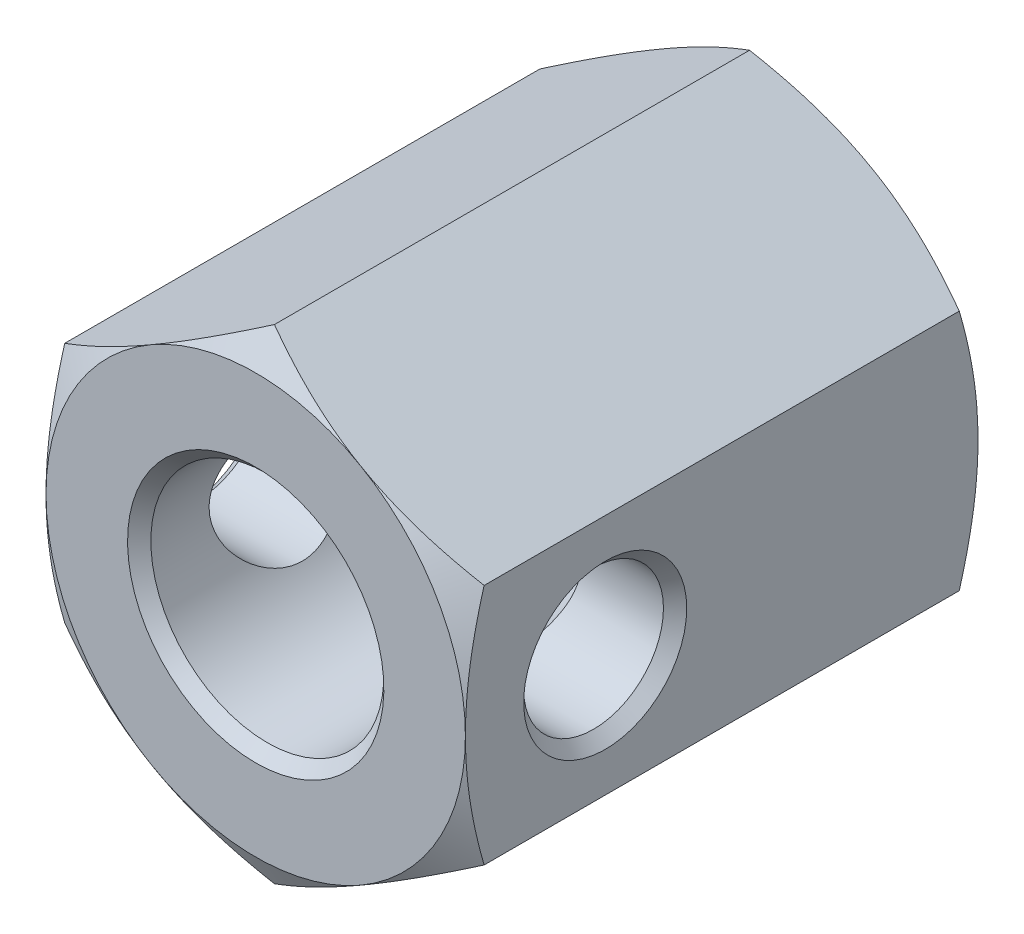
ISO-10303-21;
HEADER;
FILE_DESCRIPTION(('STEP AP214'),'2;1');
FILE_NAME('part.step','',(''),(''),'','','');
FILE_SCHEMA(('AUTOMOTIVE_DESIGN { 1 0 10303 214 1 1 1 1 }'));
ENDSEC;
DATA;
#1=APPLICATION_CONTEXT('core data for automotive mechanical design processes');
#2=APPLICATION_PROTOCOL_DEFINITION('international standard','automotive_design',2000,#1);
#3=PRODUCT_CONTEXT('',#1,'mechanical');
#4=PRODUCT('Part','Part','',(#3));
#5=PRODUCT_RELATED_PRODUCT_CATEGORY('part','',(#4));
#6=PRODUCT_DEFINITION_FORMATION('','',#4);
#7=PRODUCT_DEFINITION_CONTEXT('part definition',#1,'design');
#8=PRODUCT_DEFINITION('design','',#6,#7);
#9=PRODUCT_DEFINITION_SHAPE('','',#8);
#10=(LENGTH_UNIT() NAMED_UNIT(*) SI_UNIT(.MILLI.,.METRE.));
#11=(NAMED_UNIT(*) PLANE_ANGLE_UNIT() SI_UNIT($,.RADIAN.));
#12=(NAMED_UNIT(*) SI_UNIT($,.STERADIAN.) SOLID_ANGLE_UNIT());
#13=UNCERTAINTY_MEASURE_WITH_UNIT(LENGTH_MEASURE(1.E-05),#10,'distance_accuracy_value','');
#14=(GEOMETRIC_REPRESENTATION_CONTEXT(3) GLOBAL_UNCERTAINTY_ASSIGNED_CONTEXT((#13)) GLOBAL_UNIT_ASSIGNED_CONTEXT((#10,
#11,#12)) REPRESENTATION_CONTEXT('',''));
#15=CARTESIAN_POINT('',(0.,0.,0.));
#16=DIRECTION('',(0.,0.,1.));
#17=DIRECTION('',(1.,0.,0.));
#18=AXIS2_PLACEMENT_3D('',#15,#16,#17);
#19=CARTESIAN_POINT('',(-18.,10.3923048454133,44.));
#20=DIRECTION('',(1.,0.,0.));
#21=DIRECTION('',(0.,0.,1.));
#22=AXIS2_PLACEMENT_3D('',#19,#20,#21);
#23=PLANE('',#22);
#24=CARTESIAN_POINT('',(-18.,0.,32.));
#25=DIRECTION('',(1.,0.,0.));
#26=DIRECTION('',(0.,0.,1.));
#27=AXIS2_PLACEMENT_3D('',#24,#25,#26);
#28=CIRCLE('',#27,7.);
#29=CARTESIAN_POINT('',(-18.,0.,39.));
#30=VERTEX_POINT('',#29);
#31=EDGE_CURVE('E278',#30,#30,#28,.T.);
#32=ORIENTED_EDGE('',*,*,#31,.T.);
#33=EDGE_LOOP('',(#32));
#34=FACE_BOUND('',#33,.T.);
#35=CARTESIAN_POINT('',(-18.,27.8441297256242,8.75010496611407));
#36=CARTESIAN_POINT('',(-18.,27.4513573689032,8.55966941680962));
#37=CARTESIAN_POINT('',(-18.,27.0581221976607,8.37018887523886));
#38=CARTESIAN_POINT('',(-18.,26.2706296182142,7.99335423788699));
#39=CARTESIAN_POINT('',(-18.,25.8763721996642,7.80600016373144));
#40=CARTESIAN_POINT('',(-18.,24.6918157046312,7.24740245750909));
#41=CARTESIAN_POINT('',(-18.,23.8998496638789,6.87968035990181));
#42=CARTESIAN_POINT('',(-18.,22.3062499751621,6.15386895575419));
#43=CARTESIAN_POINT('',(-18.,21.5045871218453,5.79584361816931));
#44=CARTESIAN_POINT('',(-18.,19.8948613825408,5.09453333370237));
#45=CARTESIAN_POINT('',(-18.,19.0867988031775,4.75124768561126));
#46=CARTESIAN_POINT('',(-18.,17.4371515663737,4.07269209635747));
#47=CARTESIAN_POINT('',(-18.,16.5953179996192,3.73802411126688));
#48=CARTESIAN_POINT('',(-18.,14.9017697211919,3.09418797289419));
#49=CARTESIAN_POINT('',(-18.,14.0500539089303,2.78502269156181));
#50=CARTESIAN_POINT('',(-18.,12.3370314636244,2.20036485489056));
#51=CARTESIAN_POINT('',(-18.,11.475748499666,1.92480351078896));
#52=CARTESIAN_POINT('',(-18.,9.74074619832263,1.41622770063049));
#53=CARTESIAN_POINT('',(-18.,8.86703089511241,1.18319975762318));
#54=CARTESIAN_POINT('',(-18.,7.54940677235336,0.87466281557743));
#55=CARTESIAN_POINT('',(-18.,7.11022163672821,0.778855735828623));
#56=CARTESIAN_POINT('',(-18.,6.2288638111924,0.602057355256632));
#57=CARTESIAN_POINT('',(-18.,5.78669118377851,0.521065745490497));
#58=CARTESIAN_POINT('',(-18.,4.89967619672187,0.375333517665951));
#59=CARTESIAN_POINT('',(-18.,4.45483391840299,0.310592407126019));
#60=CARTESIAN_POINT('',(-18.,3.56293239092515,0.198651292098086));
#61=CARTESIAN_POINT('',(-18.,3.11587314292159,0.151451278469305));
#62=CARTESIAN_POINT('',(-18.,2.22599251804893,0.0761219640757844));
#63=CARTESIAN_POINT('',(-18.,1.7831915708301,0.0477527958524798));
#64=CARTESIAN_POINT('',(-18.,0.896787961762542,0.00976064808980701));
#65=CARTESIAN_POINT('',(-18.,0.453185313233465,0.000137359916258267));
#66=CARTESIAN_POINT('',(-18.,-0.434031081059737,-0.000134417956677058));
#67=CARTESIAN_POINT('',(-18.,-0.877644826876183,0.00921721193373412));
#68=CARTESIAN_POINT('',(-18.,-1.76408476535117,0.0466684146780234));
#69=CARTESIAN_POINT('',(-18.,-2.20691092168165,0.0747688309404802));
#70=CARTESIAN_POINT('',(-18.,-3.27333749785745,0.164424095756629));
#71=CARTESIAN_POINT('',(-18.,-3.89619305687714,0.234995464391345));
#72=CARTESIAN_POINT('',(-18.,-5.13723820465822,0.40936962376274));
#73=CARTESIAN_POINT('',(-18.,-5.75542713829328,0.513176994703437));
#74=CARTESIAN_POINT('',(-18.,-6.98656534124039,0.750330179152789));
#75=CARTESIAN_POINT('',(-18.,-7.59951008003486,0.883699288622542));
#76=CARTESIAN_POINT('',(-18.,-8.81922959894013,1.17590992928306));
#77=CARTESIAN_POINT('',(-18.,-9.42600447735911,1.33475105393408));
#78=CARTESIAN_POINT('',(-18.,-10.6466408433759,1.67777461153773));
#79=CARTESIAN_POINT('',(-18.,-11.2603669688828,1.86243540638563));
#80=CARTESIAN_POINT('',(-18.,-12.4817727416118,2.25067366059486));
#81=CARTESIAN_POINT('',(-18.,-13.0894523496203,2.45425124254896));
#82=CARTESIAN_POINT('',(-18.,-14.2990678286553,2.87710504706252));
#83=CARTESIAN_POINT('',(-18.,-14.9010055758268,3.09637592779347));
#84=CARTESIAN_POINT('',(-18.,-16.0999046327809,3.54805272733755));
#85=CARTESIAN_POINT('',(-18.,-16.6968659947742,3.78045850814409));
#86=CARTESIAN_POINT('',(-18.,-18.0802000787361,4.33374718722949));
#87=CARTESIAN_POINT('',(-18.,-18.8649086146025,4.65878405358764));
#88=CARTESIAN_POINT('',(-18.,-20.4278454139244,5.32412440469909));
#89=CARTESIAN_POINT('',(-18.,-21.2060733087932,5.66442875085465));
#90=CARTESIAN_POINT('',(-18.,-22.7572208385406,6.35731882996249));
#91=CARTESIAN_POINT('',(-18.,-23.5301393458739,6.70990708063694));
#92=CARTESIAN_POINT('',(-18.,-25.0713712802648,7.42494692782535));
#93=CARTESIAN_POINT('',(-18.,-25.8396847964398,7.78739833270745));
#94=CARTESIAN_POINT('',(-18.,-27.3732428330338,8.52073909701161));
#95=CARTESIAN_POINT('',(-18.,-28.1384833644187,8.89163678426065));
#96=CARTESIAN_POINT('',(-18.,-29.665699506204,9.64009261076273));
#97=CARTESIAN_POINT('',(-18.,-30.427675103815,10.0176507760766));
#98=CARTESIAN_POINT('',(-18.,-31.9487639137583,10.7782643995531));
#99=CARTESIAN_POINT('',(-18.,-32.7078774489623,11.1613192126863));
#100=CARTESIAN_POINT('',(-18.,-34.2237327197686,11.9320854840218));
#101=CARTESIAN_POINT('',(-18.,-34.9804744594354,12.3197969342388));
#102=CARTESIAN_POINT('',(-18.,-37.1249964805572,13.4255717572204));
#103=CARTESIAN_POINT('',(-18.,-38.5103701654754,14.1483024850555));
#104=CARTESIAN_POINT('',(-18.,-41.275924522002,15.6037175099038));
#105=CARTESIAN_POINT('',(-18.,-42.6561050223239,16.3364021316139));
#106=CARTESIAN_POINT('',(-18.,-45.4091059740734,17.80767341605));
#107=CARTESIAN_POINT('',(-18.,-46.7819361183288,18.546241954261));
#108=CARTESIAN_POINT('',(-18.,-48.838718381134,19.6585580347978));
#109=CARTESIAN_POINT('',(-18.,-49.5238843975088,20.0300643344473));
#110=CARTESIAN_POINT('',(-18.,-50.8934867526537,20.7744170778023));
#111=CARTESIAN_POINT('',(-18.,-51.5779230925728,21.1472635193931));
#112=CARTESIAN_POINT('',(-18.,-52.262035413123,21.5207037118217));
#113=B_SPLINE_CURVE_WITH_KNOTS('',3,(#35,#36,#37,#38,#39,#40,#41,#42,#43,#44,#45,#46,#47,#48,
#49,#50,#51,#52,#53,#54,#55,#56,#57,#58,#59,#60,#61,#62,#63,#64,#65,#66,#67,#68,#69,#70,#71,#72,
#73,#74,#75,#76,#77,#78,#79,#80,#81,#82,#83,#84,#85,#86,#87,#88,#89,#90,#91,#92,#93,#94,#95,#96,
#97,#98,#99,#100,#101,#102,#103,#104,#105,#106,#107,#108,#109,#110,#111,#112),.UNSPECIFIED.,.F.,
.F.,(4,2,2,2,2,2,2,2,2,2,2,2,2,2,2,2,2,2,2,2,2,2,2,2,2,2,2,2,2,2,2,2,2,2,2,2,2,2,4),(0.,
1.30950988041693,2.61903306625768,5.23847061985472,7.87228922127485,10.5059823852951,
13.2234192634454,15.9411617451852,18.6532440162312,21.3644654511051,22.7127971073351,
24.0611006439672,25.4093633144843,26.757625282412,28.0883655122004,29.4190838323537,
30.7498105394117,32.0805971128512,33.9600778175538,35.8398176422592,37.7210440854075,
39.602240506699,41.5245910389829,43.4469540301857,45.3686657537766,47.2903572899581,
49.8382279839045,52.3862426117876,54.9347825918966,57.4832730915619,60.0343955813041,
62.5855280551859,65.1363635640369,67.6871946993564,72.3748196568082,77.0625978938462,
81.7392554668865,84.0774640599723,86.4156689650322),.UNSPECIFIED.);
#114=CARTESIAN_POINT('',(-18.,-10.3923048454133,1.60769515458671));
#115=VERTEX_POINT('',#114);
#116=CARTESIAN_POINT('',(-18.,0.,0.));
#117=VERTEX_POINT('',#116);
#118=EDGE_CURVE('E404',#115,#117,#113,.F.);
#119=ORIENTED_EDGE('',*,*,#118,.F.);
#120=DIRECTION('',(0.,0.,-1.));
#121=VECTOR('',#120,1.);
#122=CARTESIAN_POINT('',(-18.,-10.3923048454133,44.));
#123=LINE('',#122,#121);
#124=CARTESIAN_POINT('',(-18.,-10.3923048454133,42.3923048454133));
#125=VERTEX_POINT('',#124);
#126=EDGE_CURVE('E338',#125,#115,#123,.T.);
#127=ORIENTED_EDGE('',*,*,#126,.F.);
#128=CARTESIAN_POINT('',(-18.,27.8441297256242,35.249895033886));
#129=CARTESIAN_POINT('',(-18.,27.4513573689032,35.4403305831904));
#130=CARTESIAN_POINT('',(-18.,27.0581221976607,35.6298111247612));
#131=CARTESIAN_POINT('',(-18.,26.2706296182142,36.0066457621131));
#132=CARTESIAN_POINT('',(-18.,25.8763721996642,36.1939998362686));
#133=CARTESIAN_POINT('',(-18.,24.6918157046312,36.752597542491));
#134=CARTESIAN_POINT('',(-18.,23.8998496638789,37.1203196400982));
#135=CARTESIAN_POINT('',(-18.,22.3062499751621,37.8461310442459));
#136=CARTESIAN_POINT('',(-18.,21.5045871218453,38.2041563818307));
#137=CARTESIAN_POINT('',(-18.,19.8948613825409,38.9054666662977));
#138=CARTESIAN_POINT('',(-18.,19.0867988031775,39.2487523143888));
#139=CARTESIAN_POINT('',(-18.,17.4371515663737,39.9273079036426));
#140=CARTESIAN_POINT('',(-18.,16.5953179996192,40.2619758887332));
#141=CARTESIAN_POINT('',(-18.,14.901769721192,40.9058120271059));
#142=CARTESIAN_POINT('',(-18.,14.0500539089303,41.2149773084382));
#143=CARTESIAN_POINT('',(-18.,12.3370314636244,41.7996351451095));
#144=CARTESIAN_POINT('',(-18.,11.475748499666,42.0751964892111));
#145=CARTESIAN_POINT('',(-18.,9.74074619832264,42.5837722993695));
#146=CARTESIAN_POINT('',(-18.,8.8670308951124,42.8168002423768));
#147=CARTESIAN_POINT('',(-18.,7.54940677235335,43.1253371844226));
#148=CARTESIAN_POINT('',(-18.,7.11022163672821,43.2211442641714));
#149=CARTESIAN_POINT('',(-18.,6.2288638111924,43.3979426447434));
#150=CARTESIAN_POINT('',(-18.,5.78669118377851,43.4789342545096));
#151=CARTESIAN_POINT('',(-18.,4.89967619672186,43.6246664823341));
#152=CARTESIAN_POINT('',(-18.,4.45483391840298,43.689407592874));
#153=CARTESIAN_POINT('',(-18.,3.56293239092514,43.801348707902));
#154=CARTESIAN_POINT('',(-18.,3.11587314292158,43.8485487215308));
#155=CARTESIAN_POINT('',(-18.,2.22599251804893,43.9238780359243));
#156=CARTESIAN_POINT('',(-18.,1.78319157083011,43.9522472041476));
#157=CARTESIAN_POINT('',(-18.,0.896787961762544,43.9902393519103));
#158=CARTESIAN_POINT('',(-18.,0.453185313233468,43.9998626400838));
#159=CARTESIAN_POINT('',(-18.,-0.434031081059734,44.0001344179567));
#160=CARTESIAN_POINT('',(-18.,-0.877644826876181,43.9907827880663));
#161=CARTESIAN_POINT('',(-18.,-1.76408476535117,43.953331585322));
#162=CARTESIAN_POINT('',(-18.,-2.20691092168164,43.9252311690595));
#163=CARTESIAN_POINT('',(-18.,-3.27333749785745,43.8355759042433));
#164=CARTESIAN_POINT('',(-18.,-3.89619305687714,43.7650045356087));
#165=CARTESIAN_POINT('',(-18.,-5.13723820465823,43.5906303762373));
#166=CARTESIAN_POINT('',(-18.,-5.75542713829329,43.4868230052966));
#167=CARTESIAN_POINT('',(-18.,-6.98656534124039,43.2496698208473));
#168=CARTESIAN_POINT('',(-18.,-7.59951008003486,43.1163007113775));
#169=CARTESIAN_POINT('',(-18.,-8.81922959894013,42.824090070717));
#170=CARTESIAN_POINT('',(-18.,-9.42600447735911,42.665248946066));
#171=CARTESIAN_POINT('',(-18.,-10.6466408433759,42.3222253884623));
#172=CARTESIAN_POINT('',(-18.,-11.2603669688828,42.1375645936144));
#173=CARTESIAN_POINT('',(-18.,-12.4817727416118,41.7493263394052));
#174=CARTESIAN_POINT('',(-18.,-13.0894523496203,41.5457487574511));
#175=CARTESIAN_POINT('',(-18.,-14.2990678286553,41.1228949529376));
#176=CARTESIAN_POINT('',(-18.,-14.9010055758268,40.9036240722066));
#177=CARTESIAN_POINT('',(-18.,-16.0999046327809,40.4519472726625));
#178=CARTESIAN_POINT('',(-18.,-16.6968659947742,40.2195414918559));
#179=CARTESIAN_POINT('',(-18.,-18.0802000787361,39.6662528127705));
#180=CARTESIAN_POINT('',(-18.,-18.8649086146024,39.3412159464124));
#181=CARTESIAN_POINT('',(-18.,-20.4278454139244,38.675875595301));
#182=CARTESIAN_POINT('',(-18.,-21.2060733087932,38.3355712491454));
#183=CARTESIAN_POINT('',(-18.,-22.7572208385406,37.6426811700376));
#184=CARTESIAN_POINT('',(-18.,-23.5301393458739,37.2900929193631));
#185=CARTESIAN_POINT('',(-18.,-25.0713712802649,36.5750530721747));
#186=CARTESIAN_POINT('',(-18.,-25.8396847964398,36.2126016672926));
#187=CARTESIAN_POINT('',(-18.,-27.3732428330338,35.4792609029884));
#188=CARTESIAN_POINT('',(-18.,-28.1384833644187,35.1083632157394));
#189=CARTESIAN_POINT('',(-18.,-29.665699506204,34.3599073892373));
#190=CARTESIAN_POINT('',(-18.,-30.427675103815,33.9823492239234));
#191=CARTESIAN_POINT('',(-18.,-31.9487639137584,33.221735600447));
#192=CARTESIAN_POINT('',(-18.,-32.7078774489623,32.8386807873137));
#193=CARTESIAN_POINT('',(-18.,-34.2237327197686,32.0679145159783));
#194=CARTESIAN_POINT('',(-18.,-34.9804744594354,31.6802030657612));
#195=CARTESIAN_POINT('',(-18.,-37.1249964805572,30.5744282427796));
#196=CARTESIAN_POINT('',(-18.,-38.5103701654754,29.8516975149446));
#197=CARTESIAN_POINT('',(-18.,-41.275924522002,28.3962824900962));
#198=CARTESIAN_POINT('',(-18.,-42.6561050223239,27.6635978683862));
#199=CARTESIAN_POINT('',(-18.,-45.4091059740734,26.1923265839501));
#200=CARTESIAN_POINT('',(-18.,-46.7819361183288,25.453758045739));
#201=CARTESIAN_POINT('',(-18.,-48.838718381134,24.3414419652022));
#202=CARTESIAN_POINT('',(-18.,-49.5238843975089,23.9699356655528));
#203=CARTESIAN_POINT('',(-18.,-50.8934867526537,23.2255829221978));
#204=CARTESIAN_POINT('',(-18.,-51.5779230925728,22.8527364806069));
#205=CARTESIAN_POINT('',(-18.,-52.262035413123,22.4792962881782));
#206=B_SPLINE_CURVE_WITH_KNOTS('',3,(#128,#129,#130,#131,#132,#133,#134,#135,#136,#137,#138,
#139,#140,#141,#142,#143,#144,#145,#146,#147,#148,#149,#150,#151,#152,#153,#154,#155,#156,#157,
#158,#159,#160,#161,#162,#163,#164,#165,#166,#167,#168,#169,#170,#171,#172,#173,#174,#175,#176,
#177,#178,#179,#180,#181,#182,#183,#184,#185,#186,#187,#188,#189,#190,#191,#192,#193,#194,#195,
#196,#197,#198,#199,#200,#201,#202,#203,#204,#205),.UNSPECIFIED.,.F.,.F.,(4,2,2,2,2,2,2,2,2,2,2,
2,2,2,2,2,2,2,2,2,2,2,2,2,2,2,2,2,2,2,2,2,2,2,2,2,2,2,4),(0.,1.30950988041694,2.61903306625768,
5.23847061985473,7.87228922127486,10.5059823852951,13.2234192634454,15.9411617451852,
18.6532440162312,21.3644654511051,22.7127971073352,24.0611006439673,25.4093633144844,
26.757625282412,28.0883655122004,29.4190838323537,30.7498105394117,32.0805971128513,
33.9600778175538,35.8398176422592,37.7210440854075,39.602240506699,41.5245910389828,
43.4469540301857,45.3686657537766,47.2903572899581,49.8382279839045,52.3862426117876,
54.9347825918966,57.4832730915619,60.0343955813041,62.5855280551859,65.136363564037,
67.6871946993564,72.3748196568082,77.0625978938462,81.7392554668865,84.0774640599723,
86.4156689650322),.UNSPECIFIED.);
#207=CARTESIAN_POINT('',(-18.,0.,44.));
#208=VERTEX_POINT('',#207);
#209=EDGE_CURVE('E238',#208,#125,#206,.T.);
#210=ORIENTED_EDGE('',*,*,#209,.F.);
#211=CARTESIAN_POINT('',(-18.,10.3923048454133,42.3923048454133));
#212=VERTEX_POINT('',#211);
#213=EDGE_CURVE('E412',#212,#208,#206,.T.);
#214=ORIENTED_EDGE('',*,*,#213,.F.);
#215=DIRECTION('',(0.,0.,-1.));
#216=VECTOR('',#215,1.);
#217=CARTESIAN_POINT('',(-18.,10.3923048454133,44.));
#218=LINE('',#217,#216);
#219=CARTESIAN_POINT('',(-18.,10.3923048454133,1.6076951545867));
#220=VERTEX_POINT('',#219);
#221=EDGE_CURVE('E386',#212,#220,#218,.T.);
#222=ORIENTED_EDGE('',*,*,#221,.T.);
#223=EDGE_CURVE('E192',#117,#220,#113,.F.);
#224=ORIENTED_EDGE('',*,*,#223,.F.);
#225=EDGE_LOOP('',(#119,#127,#210,#214,#222,#224));
#226=FACE_BOUND('',#225,.T.);
#227=ADVANCED_FACE('F14',(#34,#226),#23,.F.);
#228=CARTESIAN_POINT('',(-18.,-10.3923048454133,44.));
#229=DIRECTION('',(0.5,0.866025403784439,0.));
#230=DIRECTION('',(-0.866025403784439,0.5,0.));
#231=AXIS2_PLACEMENT_3D('',#228,#229,#230);
#232=PLANE('',#231);
#233=CARTESIAN_POINT('',(0.000199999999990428,-20.7847251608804,1.60776182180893));
#234=CARTESIAN_POINT('',(-0.395432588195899,-20.5563065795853,1.47589336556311));
#235=CARTESIAN_POINT('',(-0.79260835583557,-20.3269970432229,1.35000889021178));
#236=CARTESIAN_POINT('',(-1.59014476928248,-19.8665391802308,1.11187123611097));
#237=CARTESIAN_POINT('',(-1.99050641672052,-19.6353902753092,0.999622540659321));
#238=CARTESIAN_POINT('',(-2.79518836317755,-19.1708069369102,0.790265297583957));
#239=CARTESIAN_POINT('',(-3.19951570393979,-18.9373684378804,0.693192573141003));
#240=CARTESIAN_POINT('',(-4.01097986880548,-18.4688693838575,0.516271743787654));
#241=CARTESIAN_POINT('',(-4.41811653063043,-18.2338089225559,0.436422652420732));
#242=CARTESIAN_POINT('',(-5.22476711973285,-17.7680889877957,0.297345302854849));
#243=CARTESIAN_POINT('',(-5.62422116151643,-17.537464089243,0.237656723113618));
#244=CARTESIAN_POINT('',(-6.42495960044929,-17.0751575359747,0.137572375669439));
#245=CARTESIAN_POINT('',(-6.82624403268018,-16.8434758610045,0.097176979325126));
#246=CARTESIAN_POINT('',(-7.62948698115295,-16.3797233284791,0.0366989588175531));
#247=CARTESIAN_POINT('',(-8.03144412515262,-16.1476532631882,0.0165921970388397));
#248=CARTESIAN_POINT('',(-8.83572943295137,-15.6832989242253,-0.00287614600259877));
#249=CARTESIAN_POINT('',(-9.23805758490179,-15.4510146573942,-0.00223836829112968));
#250=CARTESIAN_POINT('',(-9.99021934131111,-15.0167538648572,0.0183335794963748));
#251=CARTESIAN_POINT('',(-10.3401065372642,-14.8147463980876,0.0357591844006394));
#252=CARTESIAN_POINT('',(-11.0390463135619,-14.4112133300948,0.0859690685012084));
#253=CARTESIAN_POINT('',(-11.3880989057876,-14.209687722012,0.118753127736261));
#254=CARTESIAN_POINT('',(-12.0852372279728,-13.8071947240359,0.199111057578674));
#255=CARTESIAN_POINT('',(-12.4333217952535,-13.6062280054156,0.246698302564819));
#256=CARTESIAN_POINT('',(-13.1278338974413,-13.2052512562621,0.35582287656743));
#257=CARTESIAN_POINT('',(-13.4742614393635,-13.0052412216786,0.417360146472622));
#258=CARTESIAN_POINT('',(-14.525886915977,-12.3980849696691,0.624462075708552));
#259=CARTESIAN_POINT('',(-15.228039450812,-11.99269701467,0.790677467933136));
#260=CARTESIAN_POINT('',(-16.6218747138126,-11.1879658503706,1.16791817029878));
#261=CARTESIAN_POINT('',(-17.3135752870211,-10.78861233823,1.37885488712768));
#262=CARTESIAN_POINT('',(-18.0002,-10.3921893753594,1.60776182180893));
#263=B_SPLINE_CURVE_WITH_KNOTS('',3,(#233,#234,#235,#236,#237,#238,#239,#240,#241,#242,#243,
#244,#245,#246,#247,#248,#249,#250,#251,#252,#253,#254,#255,#256,#257,#258,#259,#260,#261,#262),
.UNSPECIFIED.,.F.,.F.,(4,2,2,2,2,2,2,2,2,2,2,2,2,2,4),(0.,1.42650335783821,2.85347447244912,
4.28376471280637,5.71397301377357,7.10888071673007,8.50381526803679,9.89708828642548,
11.2903182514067,12.5031974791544,13.7160593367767,14.9300201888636,16.1439758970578,
18.6253607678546,21.1018751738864),.UNSPECIFIED.);
#264=CARTESIAN_POINT('',(0.,-20.7846096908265,1.6076951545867));
#265=VERTEX_POINT('',#264);
#266=CARTESIAN_POINT('',(-9.,-15.5884572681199,0.));
#267=VERTEX_POINT('',#266);
#268=EDGE_CURVE('E124',#265,#267,#263,.T.);
#269=ORIENTED_EDGE('',*,*,#268,.F.);
#270=DIRECTION('',(0.,0.,-1.));
#271=VECTOR('',#270,1.);
#272=CARTESIAN_POINT('',(0.,-20.7846096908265,44.));
#273=LINE('',#272,#271);
#274=CARTESIAN_POINT('',(0.,-20.7846096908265,42.3923048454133));
#275=VERTEX_POINT('',#274);
#276=EDGE_CURVE('E140',#275,#265,#273,.T.);
#277=ORIENTED_EDGE('',*,*,#276,.F.);
#278=CARTESIAN_POINT('',(-18.0002,-10.3921893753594,42.3922381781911));
#279=CARTESIAN_POINT('',(-17.6045674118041,-10.6206079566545,42.5241066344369));
#280=CARTESIAN_POINT('',(-17.2073916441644,-10.8499174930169,42.6499911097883));
#281=CARTESIAN_POINT('',(-16.4098552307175,-11.310375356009,42.8881287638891));
#282=CARTESIAN_POINT('',(-16.0094935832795,-11.5415242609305,43.0003774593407));
#283=CARTESIAN_POINT('',(-15.2048116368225,-12.0061075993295,43.2097347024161));
#284=CARTESIAN_POINT('',(-14.8004842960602,-12.2395460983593,43.3068074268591));
#285=CARTESIAN_POINT('',(-13.9890201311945,-12.7080451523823,43.4837282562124));
#286=CARTESIAN_POINT('',(-13.5818834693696,-12.9431056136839,43.5635773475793));
#287=CARTESIAN_POINT('',(-12.7752328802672,-13.4088255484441,43.7026546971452));
#288=CARTESIAN_POINT('',(-12.3757788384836,-13.6394504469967,43.7623432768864));
#289=CARTESIAN_POINT('',(-11.5750403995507,-14.1017570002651,43.8624276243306));
#290=CARTESIAN_POINT('',(-11.1737559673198,-14.3334386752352,43.9028230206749));
#291=CARTESIAN_POINT('',(-10.3705130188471,-14.7971912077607,43.9633010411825));
#292=CARTESIAN_POINT('',(-9.96855587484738,-15.0292612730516,43.9834078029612));
#293=CARTESIAN_POINT('',(-9.16427056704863,-15.4936156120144,44.0028761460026));
#294=CARTESIAN_POINT('',(-8.76194241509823,-15.7258998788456,44.0022383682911));
#295=CARTESIAN_POINT('',(-8.0097806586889,-16.1601606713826,43.9816664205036));
#296=CARTESIAN_POINT('',(-7.65989346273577,-16.3621681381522,43.9642408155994));
#297=CARTESIAN_POINT('',(-6.96095368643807,-16.765701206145,43.9140309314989));
#298=CARTESIAN_POINT('',(-6.61190109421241,-16.9672268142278,43.8812468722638));
#299=CARTESIAN_POINT('',(-5.91476277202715,-17.3697198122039,43.8008889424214));
#300=CARTESIAN_POINT('',(-5.56667820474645,-17.5706865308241,43.7533016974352));
#301=CARTESIAN_POINT('',(-4.87216610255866,-17.9716632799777,43.6441771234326));
#302=CARTESIAN_POINT('',(-4.5257385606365,-18.1716733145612,43.5826398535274));
#303=CARTESIAN_POINT('',(-3.47411308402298,-18.7788295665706,43.3755379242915));
#304=CARTESIAN_POINT('',(-2.77196054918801,-19.1842175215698,43.2093225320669));
#305=CARTESIAN_POINT('',(-1.37812528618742,-19.9889486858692,42.8320818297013));
#306=CARTESIAN_POINT('',(-0.686424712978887,-20.3883021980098,42.6211451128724));
#307=CARTESIAN_POINT('',(0.00019999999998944,-20.7847251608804,42.3922381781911));
#308=B_SPLINE_CURVE_WITH_KNOTS('',3,(#278,#279,#280,#281,#282,#283,#284,#285,#286,#287,#288,
#289,#290,#291,#292,#293,#294,#295,#296,#297,#298,#299,#300,#301,#302,#303,#304,#305,#306,#307),
.UNSPECIFIED.,.F.,.F.,(4,2,2,2,2,2,2,2,2,2,2,2,2,2,4),(0.,1.42650335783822,2.85347447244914,
4.28376471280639,5.71397301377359,7.10888071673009,8.50381526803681,9.89708828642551,
11.2903182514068,12.5031974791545,13.7160593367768,14.9300201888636,16.1439758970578,
18.6253607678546,21.1018751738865),.UNSPECIFIED.);
#309=CARTESIAN_POINT('',(-9.,-15.5884572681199,44.));
#310=VERTEX_POINT('',#309);
#311=EDGE_CURVE('E231',#310,#275,#308,.T.);
#312=ORIENTED_EDGE('',*,*,#311,.F.);
#313=EDGE_CURVE('E237',#125,#310,#308,.T.);
#314=ORIENTED_EDGE('',*,*,#313,.F.);
#315=ORIENTED_EDGE('',*,*,#126,.T.);
#316=EDGE_CURVE('E150',#267,#115,#263,.T.);
#317=ORIENTED_EDGE('',*,*,#316,.F.);
#318=EDGE_LOOP('',(#269,#277,#312,#314,#315,#317));
#319=FACE_BOUND('',#318,.T.);
#320=ADVANCED_FACE('F244',(#319),#232,.F.);
#321=CARTESIAN_POINT('',(0.,-20.7846096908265,44.));
#322=DIRECTION('',(-0.5,0.866025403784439,0.));
#323=DIRECTION('',(-0.866025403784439,-0.5,0.));
#324=AXIS2_PLACEMENT_3D('',#321,#322,#323);
#325=PLANE('',#324);
#326=CARTESIAN_POINT('',(18.0002,-10.3921893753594,1.60776182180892));
#327=CARTESIAN_POINT('',(17.6045674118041,-10.6206079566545,1.47589336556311));
#328=CARTESIAN_POINT('',(17.2073916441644,-10.8499174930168,1.35000889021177));
#329=CARTESIAN_POINT('',(16.4098552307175,-11.3103753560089,1.11187123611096));
#330=CARTESIAN_POINT('',(16.0094935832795,-11.5415242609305,0.999622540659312));
#331=CARTESIAN_POINT('',(15.2048116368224,-12.0061075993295,0.790265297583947));
#332=CARTESIAN_POINT('',(14.8004842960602,-12.2395460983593,0.693192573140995));
#333=CARTESIAN_POINT('',(13.9890201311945,-12.7080451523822,0.516271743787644));
#334=CARTESIAN_POINT('',(13.5818834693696,-12.9431056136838,0.436422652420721));
#335=CARTESIAN_POINT('',(12.7752328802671,-13.4088255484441,0.297345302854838));
#336=CARTESIAN_POINT('',(12.3757788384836,-13.6394504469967,0.237656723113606));
#337=CARTESIAN_POINT('',(11.5750403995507,-14.1017570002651,0.137572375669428));
#338=CARTESIAN_POINT('',(11.1737559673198,-14.3334386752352,0.0971769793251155));
#339=CARTESIAN_POINT('',(10.370513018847,-14.7971912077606,0.0366989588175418));
#340=CARTESIAN_POINT('',(9.96855587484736,-15.0292612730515,0.0165921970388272));
#341=CARTESIAN_POINT('',(9.16427056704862,-15.4936156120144,-0.00287614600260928));
#342=CARTESIAN_POINT('',(8.76194241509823,-15.7258998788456,-0.00223836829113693));
#343=CARTESIAN_POINT('',(8.0097806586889,-16.1601606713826,0.018333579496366));
#344=CARTESIAN_POINT('',(7.65989346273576,-16.3621681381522,0.0357591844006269));
#345=CARTESIAN_POINT('',(6.96095368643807,-16.7657012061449,0.085969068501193));
#346=CARTESIAN_POINT('',(6.6119010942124,-16.9672268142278,0.118753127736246));
#347=CARTESIAN_POINT('',(5.91476277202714,-17.3697198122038,0.19911105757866));
#348=CARTESIAN_POINT('',(5.56667820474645,-17.5706865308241,0.246698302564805));
#349=CARTESIAN_POINT('',(4.87216610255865,-17.9716632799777,0.355822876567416));
#350=CARTESIAN_POINT('',(4.52573856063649,-18.1716733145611,0.417360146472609));
#351=CARTESIAN_POINT('',(3.47411308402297,-18.7788295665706,0.624462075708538));
#352=CARTESIAN_POINT('',(2.771960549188,-19.1842175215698,0.79067746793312));
#353=CARTESIAN_POINT('',(1.37812528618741,-19.9889486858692,1.16791817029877));
#354=CARTESIAN_POINT('',(0.686424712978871,-20.3883021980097,1.37885488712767));
#355=CARTESIAN_POINT('',(-0.00020000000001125,-20.7847251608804,1.60776182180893));
#356=B_SPLINE_CURVE_WITH_KNOTS('',3,(#326,#327,#328,#329,#330,#331,#332,#333,#334,#335,#336,
#337,#338,#339,#340,#341,#342,#343,#344,#345,#346,#347,#348,#349,#350,#351,#352,#353,#354,#355),
.UNSPECIFIED.,.F.,.F.,(4,2,2,2,2,2,2,2,2,2,2,2,2,2,4),(0.,1.42650335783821,2.85347447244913,
4.28376471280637,5.71397301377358,7.10888071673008,8.50381526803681,9.8970882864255,
11.2903182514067,12.5031974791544,13.7160593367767,14.9300201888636,16.1439758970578,
18.6253607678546,21.1018751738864),.UNSPECIFIED.);
#357=CARTESIAN_POINT('',(18.,-10.3923048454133,1.6076951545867));
#358=VERTEX_POINT('',#357);
#359=CARTESIAN_POINT('',(9.,-15.5884572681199,0.));
#360=VERTEX_POINT('',#359);
#361=EDGE_CURVE('E103',#358,#360,#356,.T.);
#362=ORIENTED_EDGE('',*,*,#361,.F.);
#363=DIRECTION('',(0.,0.,-1.));
#364=VECTOR('',#363,1.);
#365=CARTESIAN_POINT('',(18.,-10.3923048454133,44.));
#366=LINE('',#365,#364);
#367=CARTESIAN_POINT('',(18.,-10.3923048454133,42.3923048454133));
#368=VERTEX_POINT('',#367);
#369=EDGE_CURVE('E388',#368,#358,#366,.T.);
#370=ORIENTED_EDGE('',*,*,#369,.F.);
#371=CARTESIAN_POINT('',(-0.000200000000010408,-20.7847251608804,42.3922381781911));
#372=CARTESIAN_POINT('',(0.395432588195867,-20.5563065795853,42.5241066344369));
#373=CARTESIAN_POINT('',(0.792608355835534,-20.3269970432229,42.6499911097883));
#374=CARTESIAN_POINT('',(1.59014476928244,-19.8665391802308,42.8881287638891));
#375=CARTESIAN_POINT('',(1.99050641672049,-19.6353902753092,43.0003774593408));
#376=CARTESIAN_POINT('',(2.79518836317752,-19.1708069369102,43.2097347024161));
#377=CARTESIAN_POINT('',(3.19951570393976,-18.9373684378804,43.3068074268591));
#378=CARTESIAN_POINT('',(4.01097986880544,-18.4688693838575,43.4837282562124));
#379=CARTESIAN_POINT('',(4.4181165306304,-18.2338089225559,43.5635773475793));
#380=CARTESIAN_POINT('',(5.22476711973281,-17.7680889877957,43.7026546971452));
#381=CARTESIAN_POINT('',(5.62422116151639,-17.537464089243,43.7623432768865));
#382=CARTESIAN_POINT('',(6.42495960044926,-17.0751575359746,43.8624276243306));
#383=CARTESIAN_POINT('',(6.82624403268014,-16.8434758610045,43.9028230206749));
#384=CARTESIAN_POINT('',(7.62948698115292,-16.3797233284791,43.9633010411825));
#385=CARTESIAN_POINT('',(8.03144412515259,-16.1476532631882,43.9834078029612));
#386=CARTESIAN_POINT('',(8.83572943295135,-15.6832989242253,44.0028761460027));
#387=CARTESIAN_POINT('',(9.23805758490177,-15.4510146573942,44.0022383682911));
#388=CARTESIAN_POINT('',(9.99021934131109,-15.0167538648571,43.9816664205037));
#389=CARTESIAN_POINT('',(10.3401065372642,-14.8147463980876,43.9642408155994));
#390=CARTESIAN_POINT('',(11.0390463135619,-14.4112133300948,43.9140309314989));
#391=CARTESIAN_POINT('',(11.3880989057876,-14.209687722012,43.8812468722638));
#392=CARTESIAN_POINT('',(12.0852372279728,-13.8071947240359,43.8008889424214));
#393=CARTESIAN_POINT('',(12.4333217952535,-13.6062280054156,43.7533016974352));
#394=CARTESIAN_POINT('',(13.1278338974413,-13.2052512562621,43.6441771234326));
#395=CARTESIAN_POINT('',(13.4742614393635,-13.0052412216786,43.5826398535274));
#396=CARTESIAN_POINT('',(14.525886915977,-12.3980849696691,43.3755379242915));
#397=CARTESIAN_POINT('',(15.228039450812,-11.99269701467,43.2093225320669));
#398=CARTESIAN_POINT('',(16.6218747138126,-11.1879658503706,42.8320818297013));
#399=CARTESIAN_POINT('',(17.3135752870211,-10.78861233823,42.6211451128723));
#400=CARTESIAN_POINT('',(18.0002,-10.3921893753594,42.3922381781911));
#401=B_SPLINE_CURVE_WITH_KNOTS('',3,(#371,#372,#373,#374,#375,#376,#377,#378,#379,#380,#381,
#382,#383,#384,#385,#386,#387,#388,#389,#390,#391,#392,#393,#394,#395,#396,#397,#398,#399,#400),
.UNSPECIFIED.,.F.,.F.,(4,2,2,2,2,2,2,2,2,2,2,2,2,2,4),(0.,1.42650335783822,2.85347447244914,
4.28376471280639,5.71397301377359,7.10888071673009,8.50381526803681,9.8970882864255,
11.2903182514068,12.5031974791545,13.7160593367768,14.9300201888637,16.1439758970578,
18.6253607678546,21.1018751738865),.UNSPECIFIED.);
#402=CARTESIAN_POINT('',(9.,-15.5884572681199,44.));
#403=VERTEX_POINT('',#402);
#404=EDGE_CURVE('E224',#403,#368,#401,.T.);
#405=ORIENTED_EDGE('',*,*,#404,.F.);
#406=EDGE_CURVE('E230',#275,#403,#401,.T.);
#407=ORIENTED_EDGE('',*,*,#406,.F.);
#408=ORIENTED_EDGE('',*,*,#276,.T.);
#409=EDGE_CURVE('E116',#360,#265,#356,.T.);
#410=ORIENTED_EDGE('',*,*,#409,.F.);
#411=EDGE_LOOP('',(#362,#370,#405,#407,#408,#410));
#412=FACE_BOUND('',#411,.T.);
#413=ADVANCED_FACE('F137',(#412),#325,.F.);
#414=CARTESIAN_POINT('',(18.,-10.3923048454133,44.));
#415=DIRECTION('',(-1.,0.,0.));
#416=DIRECTION('',(0.,0.,-1.));
#417=AXIS2_PLACEMENT_3D('',#414,#415,#416);
#418=PLANE('',#417);
#419=CARTESIAN_POINT('',(18.,0.,32.));
#420=DIRECTION('',(-1.,0.,0.));
#421=DIRECTION('',(0.,0.,-1.));
#422=AXIS2_PLACEMENT_3D('',#419,#420,#421);
#423=CIRCLE('',#422,7.);
#424=CARTESIAN_POINT('',(18.,0.,25.));
#425=VERTEX_POINT('',#424);
#426=EDGE_CURVE('E9',#425,#425,#423,.T.);
#427=ORIENTED_EDGE('',*,*,#426,.T.);
#428=EDGE_LOOP('',(#427));
#429=FACE_BOUND('',#428,.T.);
#430=CARTESIAN_POINT('',(18.,27.8441297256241,8.75010496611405));
#431=CARTESIAN_POINT('',(18.,27.4513573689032,8.5596694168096));
#432=CARTESIAN_POINT('',(18.,27.0581221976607,8.37018887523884));
#433=CARTESIAN_POINT('',(18.,26.2706296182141,7.99335423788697));
#434=CARTESIAN_POINT('',(18.,25.8763721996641,7.80600016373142));
#435=CARTESIAN_POINT('',(18.,24.6918157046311,7.24740245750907));
#436=CARTESIAN_POINT('',(18.,23.8998496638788,6.8796803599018));
#437=CARTESIAN_POINT('',(18.,22.3062499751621,6.15386895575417));
#438=CARTESIAN_POINT('',(18.,21.5045871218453,5.79584361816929));
#439=CARTESIAN_POINT('',(18.,19.8948613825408,5.09453333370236));
#440=CARTESIAN_POINT('',(18.,19.0867988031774,4.75124768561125));
#441=CARTESIAN_POINT('',(18.,17.4371515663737,4.07269209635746));
#442=CARTESIAN_POINT('',(18.,16.5953179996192,3.73802411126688));
#443=CARTESIAN_POINT('',(18.,14.9017697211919,3.09418797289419));
#444=CARTESIAN_POINT('',(18.,14.0500539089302,2.7850226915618));
#445=CARTESIAN_POINT('',(18.,12.3370314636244,2.20036485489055));
#446=CARTESIAN_POINT('',(18.,11.475748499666,1.92480351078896));
#447=CARTESIAN_POINT('',(18.,9.74074619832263,1.41622770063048));
#448=CARTESIAN_POINT('',(18.,8.86703089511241,1.18319975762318));
#449=CARTESIAN_POINT('',(18.,7.54940677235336,0.874662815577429));
#450=CARTESIAN_POINT('',(18.,7.11022163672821,0.778855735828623));
#451=CARTESIAN_POINT('',(18.,6.2288638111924,0.602057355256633));
#452=CARTESIAN_POINT('',(18.,5.78669118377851,0.521065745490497));
#453=CARTESIAN_POINT('',(18.,4.89967619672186,0.375333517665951));
#454=CARTESIAN_POINT('',(18.,4.45483391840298,0.310592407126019));
#455=CARTESIAN_POINT('',(18.,3.56293239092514,0.198651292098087));
#456=CARTESIAN_POINT('',(18.,3.11587314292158,0.151451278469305));
#457=CARTESIAN_POINT('',(18.,2.22599251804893,0.0761219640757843));
#458=CARTESIAN_POINT('',(18.,1.7831915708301,0.0477527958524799));
#459=CARTESIAN_POINT('',(18.,0.89678796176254,0.009760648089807));
#460=CARTESIAN_POINT('',(18.,0.453185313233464,0.000137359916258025));
#461=CARTESIAN_POINT('',(18.,-0.434031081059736,-0.000134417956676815));
#462=CARTESIAN_POINT('',(18.,-0.877644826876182,0.00921721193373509));
#463=CARTESIAN_POINT('',(18.,-1.76408476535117,0.0466684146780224));
#464=CARTESIAN_POINT('',(18.,-2.20691092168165,0.0747688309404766));
#465=CARTESIAN_POINT('',(18.,-3.27333749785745,0.164424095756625));
#466=CARTESIAN_POINT('',(18.,-3.89619305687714,0.234995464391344));
#467=CARTESIAN_POINT('',(18.,-5.13723820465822,0.409369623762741));
#468=CARTESIAN_POINT('',(18.,-5.75542713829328,0.513176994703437));
#469=CARTESIAN_POINT('',(18.,-6.98656534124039,0.750330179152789));
#470=CARTESIAN_POINT('',(18.,-7.59951008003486,0.883699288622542));
#471=CARTESIAN_POINT('',(18.,-8.81922959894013,1.17590992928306));
#472=CARTESIAN_POINT('',(18.,-9.42600447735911,1.33475105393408));
#473=CARTESIAN_POINT('',(18.,-10.6466408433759,1.67777461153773));
#474=CARTESIAN_POINT('',(18.,-11.2603669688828,1.86243540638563));
#475=CARTESIAN_POINT('',(18.,-12.4817727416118,2.25067366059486));
#476=CARTESIAN_POINT('',(18.,-13.0894523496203,2.45425124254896));
#477=CARTESIAN_POINT('',(18.,-14.2990678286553,2.87710504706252));
#478=CARTESIAN_POINT('',(18.,-14.9010055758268,3.09637592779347));
#479=CARTESIAN_POINT('',(18.,-16.0999046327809,3.54805272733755));
#480=CARTESIAN_POINT('',(18.,-16.6968659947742,3.78045850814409));
#481=CARTESIAN_POINT('',(18.,-18.0802000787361,4.33374718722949));
#482=CARTESIAN_POINT('',(18.,-18.8649086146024,4.65878405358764));
#483=CARTESIAN_POINT('',(18.,-20.4278454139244,5.32412440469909));
#484=CARTESIAN_POINT('',(18.,-21.2060733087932,5.66442875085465));
#485=CARTESIAN_POINT('',(18.,-22.7572208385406,6.35731882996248));
#486=CARTESIAN_POINT('',(18.,-23.5301393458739,6.70990708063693));
#487=CARTESIAN_POINT('',(18.,-25.0713712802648,7.42494692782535));
#488=CARTESIAN_POINT('',(18.,-25.8396847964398,7.78739833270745));
#489=CARTESIAN_POINT('',(18.,-27.3732428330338,8.5207390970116));
#490=CARTESIAN_POINT('',(18.,-28.1384833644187,8.89163678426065));
#491=CARTESIAN_POINT('',(18.,-29.665699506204,9.64009261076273));
#492=CARTESIAN_POINT('',(18.,-30.427675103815,10.0176507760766));
#493=CARTESIAN_POINT('',(18.,-31.9487639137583,10.778264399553));
#494=CARTESIAN_POINT('',(18.,-32.7078774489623,11.1613192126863));
#495=CARTESIAN_POINT('',(18.,-34.2237327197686,11.9320854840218));
#496=CARTESIAN_POINT('',(18.,-34.9804744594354,12.3197969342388));
#497=CARTESIAN_POINT('',(18.,-37.1249964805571,13.4255717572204));
#498=CARTESIAN_POINT('',(18.,-38.5103701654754,14.1483024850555));
#499=CARTESIAN_POINT('',(18.,-41.275924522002,15.6037175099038));
#500=CARTESIAN_POINT('',(18.,-42.6561050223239,16.3364021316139));
#501=CARTESIAN_POINT('',(18.,-45.4091059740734,17.80767341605));
#502=CARTESIAN_POINT('',(18.,-46.7819361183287,18.546241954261));
#503=CARTESIAN_POINT('',(18.,-48.8387183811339,19.6585580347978));
#504=CARTESIAN_POINT('',(18.,-49.5238843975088,20.0300643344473));
#505=CARTESIAN_POINT('',(18.,-50.8934867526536,20.7744170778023));
#506=CARTESIAN_POINT('',(18.,-51.5779230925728,21.1472635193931));
#507=CARTESIAN_POINT('',(18.,-52.262035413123,21.5207037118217));
#508=B_SPLINE_CURVE_WITH_KNOTS('',3,(#430,#431,#432,#433,#434,#435,#436,#437,#438,#439,#440,
#441,#442,#443,#444,#445,#446,#447,#448,#449,#450,#451,#452,#453,#454,#455,#456,#457,#458,#459,
#460,#461,#462,#463,#464,#465,#466,#467,#468,#469,#470,#471,#472,#473,#474,#475,#476,#477,#478,
#479,#480,#481,#482,#483,#484,#485,#486,#487,#488,#489,#490,#491,#492,#493,#494,#495,#496,#497,
#498,#499,#500,#501,#502,#503,#504,#505,#506,#507),.UNSPECIFIED.,.F.,.F.,(4,2,2,2,2,2,2,2,2,2,2,
2,2,2,2,2,2,2,2,2,2,2,2,2,2,2,2,2,2,2,2,2,2,2,2,2,2,2,4),(0.,1.30950988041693,2.61903306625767,
5.2384706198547,7.87228922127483,10.5059823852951,13.2234192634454,15.9411617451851,
18.6532440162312,21.364465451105,22.7127971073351,24.0611006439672,25.4093633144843,
26.757625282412,28.0883655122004,29.4190838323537,30.7498105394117,32.0805971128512,
33.9600778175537,35.8398176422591,37.7210440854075,39.6022405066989,41.5245910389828,
43.4469540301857,45.3686657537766,47.2903572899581,49.8382279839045,52.3862426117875,
54.9347825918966,57.4832730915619,60.0343955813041,62.5855280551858,65.1363635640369,
67.6871946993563,72.3748196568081,77.0625978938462,81.7392554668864,84.0774640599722,
86.4156689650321),.UNSPECIFIED.);
#509=CARTESIAN_POINT('',(18.,10.3923048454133,1.6076951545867));
#510=VERTEX_POINT('',#509);
#511=CARTESIAN_POINT('',(18.,0.,0.));
#512=VERTEX_POINT('',#511);
#513=EDGE_CURVE('E29',#510,#512,#508,.T.);
#514=ORIENTED_EDGE('',*,*,#513,.F.);
#515=DIRECTION('',(0.,0.,-1.));
#516=VECTOR('',#515,1.);
#517=CARTESIAN_POINT('',(18.,10.3923048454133,44.));
#518=LINE('',#517,#516);
#519=CARTESIAN_POINT('',(18.,10.3923048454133,42.3923048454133));
#520=VERTEX_POINT('',#519);
#521=EDGE_CURVE('E385',#520,#510,#518,.T.);
#522=ORIENTED_EDGE('',*,*,#521,.F.);
#523=CARTESIAN_POINT('',(18.,27.8441297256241,35.249895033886));
#524=CARTESIAN_POINT('',(18.,27.4513573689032,35.4403305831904));
#525=CARTESIAN_POINT('',(18.,27.0581221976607,35.6298111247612));
#526=CARTESIAN_POINT('',(18.,26.2706296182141,36.0066457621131));
#527=CARTESIAN_POINT('',(18.,25.8763721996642,36.1939998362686));
#528=CARTESIAN_POINT('',(18.,24.6918157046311,36.752597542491));
#529=CARTESIAN_POINT('',(18.,23.8998496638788,37.1203196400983));
#530=CARTESIAN_POINT('',(18.,22.3062499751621,37.8461310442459));
#531=CARTESIAN_POINT('',(18.,21.5045871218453,38.2041563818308));
#532=CARTESIAN_POINT('',(18.,19.8948613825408,38.9054666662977));
#533=CARTESIAN_POINT('',(18.,19.0867988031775,39.2487523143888));
#534=CARTESIAN_POINT('',(18.,17.4371515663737,39.9273079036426));
#535=CARTESIAN_POINT('',(18.,16.5953179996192,40.2619758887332));
#536=CARTESIAN_POINT('',(18.,14.9017697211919,40.9058120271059));
#537=CARTESIAN_POINT('',(18.,14.0500539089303,41.2149773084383));
#538=CARTESIAN_POINT('',(18.,12.3370314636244,41.7996351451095));
#539=CARTESIAN_POINT('',(18.,11.475748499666,42.0751964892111));
#540=CARTESIAN_POINT('',(18.,9.74074619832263,42.5837722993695));
#541=CARTESIAN_POINT('',(18.,8.8670308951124,42.8168002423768));
#542=CARTESIAN_POINT('',(18.,7.54940677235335,43.1253371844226));
#543=CARTESIAN_POINT('',(18.,7.11022163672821,43.2211442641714));
#544=CARTESIAN_POINT('',(18.,6.2288638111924,43.3979426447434));
#545=CARTESIAN_POINT('',(18.,5.78669118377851,43.4789342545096));
#546=CARTESIAN_POINT('',(18.,4.89967619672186,43.6246664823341));
#547=CARTESIAN_POINT('',(18.,4.45483391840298,43.689407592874));
#548=CARTESIAN_POINT('',(18.,3.56293239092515,43.801348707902));
#549=CARTESIAN_POINT('',(18.,3.11587314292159,43.8485487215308));
#550=CARTESIAN_POINT('',(18.,2.22599251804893,43.9238780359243));
#551=CARTESIAN_POINT('',(18.,1.7831915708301,43.9522472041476));
#552=CARTESIAN_POINT('',(18.,0.896787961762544,43.9902393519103));
#553=CARTESIAN_POINT('',(18.,0.45318531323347,43.9998626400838));
#554=CARTESIAN_POINT('',(18.,-0.434031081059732,44.0001344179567));
#555=CARTESIAN_POINT('',(18.,-0.87764482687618,43.9907827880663));
#556=CARTESIAN_POINT('',(18.,-1.76408476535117,43.953331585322));
#557=CARTESIAN_POINT('',(18.,-2.20691092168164,43.9252311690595));
#558=CARTESIAN_POINT('',(18.,-3.27333749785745,43.8355759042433));
#559=CARTESIAN_POINT('',(18.,-3.89619305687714,43.7650045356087));
#560=CARTESIAN_POINT('',(18.,-5.13723820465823,43.5906303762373));
#561=CARTESIAN_POINT('',(18.,-5.75542713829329,43.4868230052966));
#562=CARTESIAN_POINT('',(18.,-6.9865653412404,43.2496698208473));
#563=CARTESIAN_POINT('',(18.,-7.59951008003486,43.1163007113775));
#564=CARTESIAN_POINT('',(18.,-8.81922959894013,42.824090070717));
#565=CARTESIAN_POINT('',(18.,-9.42600447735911,42.665248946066));
#566=CARTESIAN_POINT('',(18.,-10.6466408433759,42.3222253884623));
#567=CARTESIAN_POINT('',(18.,-11.2603669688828,42.1375645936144));
#568=CARTESIAN_POINT('',(18.,-12.4817727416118,41.7493263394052));
#569=CARTESIAN_POINT('',(18.,-13.0894523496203,41.5457487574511));
#570=CARTESIAN_POINT('',(18.,-14.2990678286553,41.1228949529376));
#571=CARTESIAN_POINT('',(18.,-14.9010055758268,40.9036240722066));
#572=CARTESIAN_POINT('',(18.,-16.0999046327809,40.4519472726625));
#573=CARTESIAN_POINT('',(18.,-16.6968659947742,40.2195414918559));
#574=CARTESIAN_POINT('',(18.,-18.0802000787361,39.6662528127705));
#575=CARTESIAN_POINT('',(18.,-18.8649086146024,39.3412159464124));
#576=CARTESIAN_POINT('',(18.,-20.4278454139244,38.675875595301));
#577=CARTESIAN_POINT('',(18.,-21.2060733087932,38.3355712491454));
#578=CARTESIAN_POINT('',(18.,-22.7572208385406,37.6426811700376));
#579=CARTESIAN_POINT('',(18.,-23.5301393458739,37.2900929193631));
#580=CARTESIAN_POINT('',(18.,-25.0713712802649,36.5750530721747));
#581=CARTESIAN_POINT('',(18.,-25.8396847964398,36.2126016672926));
#582=CARTESIAN_POINT('',(18.,-27.3732428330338,35.4792609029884));
#583=CARTESIAN_POINT('',(18.,-28.1384833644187,35.1083632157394));
#584=CARTESIAN_POINT('',(18.,-29.665699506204,34.3599073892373));
#585=CARTESIAN_POINT('',(18.,-30.427675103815,33.9823492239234));
#586=CARTESIAN_POINT('',(18.,-31.9487639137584,33.221735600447));
#587=CARTESIAN_POINT('',(18.,-32.7078774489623,32.8386807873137));
#588=CARTESIAN_POINT('',(18.,-34.2237327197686,32.0679145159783));
#589=CARTESIAN_POINT('',(18.,-34.9804744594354,31.6802030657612));
#590=CARTESIAN_POINT('',(18.,-37.1249964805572,30.5744282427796));
#591=CARTESIAN_POINT('',(18.,-38.5103701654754,29.8516975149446));
#592=CARTESIAN_POINT('',(18.,-41.275924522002,28.3962824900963));
#593=CARTESIAN_POINT('',(18.,-42.6561050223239,27.6635978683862));
#594=CARTESIAN_POINT('',(18.,-45.4091059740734,26.1923265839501));
#595=CARTESIAN_POINT('',(18.,-46.7819361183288,25.453758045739));
#596=CARTESIAN_POINT('',(18.,-48.838718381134,24.3414419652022));
#597=CARTESIAN_POINT('',(18.,-49.5238843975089,23.9699356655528));
#598=CARTESIAN_POINT('',(18.,-50.8934867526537,23.2255829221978));
#599=CARTESIAN_POINT('',(18.,-51.5779230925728,22.8527364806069));
#600=CARTESIAN_POINT('',(18.,-52.262035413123,22.4792962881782));
#601=B_SPLINE_CURVE_WITH_KNOTS('',3,(#523,#524,#525,#526,#527,#528,#529,#530,#531,#532,#533,
#534,#535,#536,#537,#538,#539,#540,#541,#542,#543,#544,#545,#546,#547,#548,#549,#550,#551,#552,
#553,#554,#555,#556,#557,#558,#559,#560,#561,#562,#563,#564,#565,#566,#567,#568,#569,#570,#571,
#572,#573,#574,#575,#576,#577,#578,#579,#580,#581,#582,#583,#584,#585,#586,#587,#588,#589,#590,
#591,#592,#593,#594,#595,#596,#597,#598,#599,#600),.UNSPECIFIED.,.F.,.F.,(4,2,2,2,2,2,2,2,2,2,2,
2,2,2,2,2,2,2,2,2,2,2,2,2,2,2,2,2,2,2,2,2,2,2,2,2,2,2,4),(0.,1.30950988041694,2.61903306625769,
5.23847061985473,7.87228922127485,10.5059823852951,13.2234192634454,15.9411617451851,
18.6532440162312,21.364465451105,22.7127971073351,24.0611006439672,25.4093633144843,
26.757625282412,28.0883655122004,29.4190838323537,30.7498105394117,32.0805971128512,
33.9600778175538,35.8398176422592,37.7210440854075,39.6022405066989,41.5245910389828,
43.4469540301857,45.3686657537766,47.2903572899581,49.8382279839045,52.3862426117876,
54.9347825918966,57.4832730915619,60.0343955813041,62.5855280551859,65.1363635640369,
67.6871946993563,72.3748196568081,77.0625978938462,81.7392554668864,84.0774640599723,
86.4156689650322),.UNSPECIFIED.);
#602=CARTESIAN_POINT('',(18.,0.,44.));
#603=VERTEX_POINT('',#602);
#604=EDGE_CURVE('E211',#603,#520,#601,.F.);
#605=ORIENTED_EDGE('',*,*,#604,.F.);
#606=EDGE_CURVE('E217',#368,#603,#601,.F.);
#607=ORIENTED_EDGE('',*,*,#606,.F.);
#608=ORIENTED_EDGE('',*,*,#369,.T.);
#609=EDGE_CURVE('E110',#512,#358,#508,.T.);
#610=ORIENTED_EDGE('',*,*,#609,.F.);
#611=EDGE_LOOP('',(#514,#522,#605,#607,#608,#610));
#612=FACE_BOUND('',#611,.T.);
#613=ADVANCED_FACE('F203',(#429,#612),#418,.F.);
#614=CARTESIAN_POINT('',(18.,10.3923048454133,44.));
#615=DIRECTION('',(-0.5,-0.866025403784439,0.));
#616=DIRECTION('',(0.866025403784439,-0.5,0.));
#617=AXIS2_PLACEMENT_3D('',#614,#615,#616);
#618=PLANE('',#617);
#619=CARTESIAN_POINT('',(-0.000200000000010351,20.7847251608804,1.60776182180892));
#620=CARTESIAN_POINT('',(0.395432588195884,20.5563065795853,1.47589336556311));
#621=CARTESIAN_POINT('',(0.792608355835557,20.3269970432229,1.35000889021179));
#622=CARTESIAN_POINT('',(1.59014476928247,19.8665391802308,1.11187123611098));
#623=CARTESIAN_POINT('',(1.99050641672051,19.6353902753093,0.999622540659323));
#624=CARTESIAN_POINT('',(2.79518836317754,19.1708069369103,0.790265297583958));
#625=CARTESIAN_POINT('',(3.19951570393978,18.9373684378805,0.693192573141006));
#626=CARTESIAN_POINT('',(4.01097986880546,18.4688693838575,0.516271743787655));
#627=CARTESIAN_POINT('',(4.41811653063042,18.2338089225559,0.436422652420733));
#628=CARTESIAN_POINT('',(5.22476711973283,17.7680889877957,0.297345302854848));
#629=CARTESIAN_POINT('',(5.62422116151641,17.537464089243,0.237656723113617));
#630=CARTESIAN_POINT('',(6.42495960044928,17.0751575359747,0.13757237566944));
#631=CARTESIAN_POINT('',(6.82624403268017,16.8434758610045,0.0971769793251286));
#632=CARTESIAN_POINT('',(7.62948698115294,16.3797233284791,0.0366989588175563));
#633=CARTESIAN_POINT('',(8.03144412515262,16.1476532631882,0.0165921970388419));
#634=CARTESIAN_POINT('',(8.83572943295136,15.6832989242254,-0.00287614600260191));
#635=CARTESIAN_POINT('',(9.23805758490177,15.4510146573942,-0.00223836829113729));
#636=CARTESIAN_POINT('',(9.99021934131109,15.0167538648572,0.0183335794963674));
#637=CARTESIAN_POINT('',(10.3401065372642,14.8147463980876,0.0357591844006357));
#638=CARTESIAN_POINT('',(11.0390463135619,14.4112133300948,0.085969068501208));
#639=CARTESIAN_POINT('',(11.3880989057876,14.209687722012,0.11875312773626));
#640=CARTESIAN_POINT('',(12.0852372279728,13.8071947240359,0.199111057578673));
#641=CARTESIAN_POINT('',(12.4333217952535,13.6062280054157,0.246698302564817));
#642=CARTESIAN_POINT('',(13.1278338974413,13.2052512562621,0.355822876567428));
#643=CARTESIAN_POINT('',(13.4742614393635,13.0052412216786,0.417360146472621));
#644=CARTESIAN_POINT('',(14.525886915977,12.3980849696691,0.624462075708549));
#645=CARTESIAN_POINT('',(15.228039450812,11.99269701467,0.790677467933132));
#646=CARTESIAN_POINT('',(16.6218747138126,11.1879658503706,1.16791817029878));
#647=CARTESIAN_POINT('',(17.3135752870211,10.78861233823,1.37885488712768));
#648=CARTESIAN_POINT('',(18.0002,10.3921893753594,1.60776182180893));
#649=B_SPLINE_CURVE_WITH_KNOTS('',3,(#619,#620,#621,#622,#623,#624,#625,#626,#627,#628,#629,
#630,#631,#632,#633,#634,#635,#636,#637,#638,#639,#640,#641,#642,#643,#644,#645,#646,#647,#648),
.UNSPECIFIED.,.F.,.F.,(4,2,2,2,2,2,2,2,2,2,2,2,2,2,4),(0.,1.42650335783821,2.85347447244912,
4.28376471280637,5.71397301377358,7.10888071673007,8.5038152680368,9.89708828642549,
11.2903182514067,12.5031974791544,13.7160593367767,14.9300201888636,16.1439758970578,
18.6253607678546,21.1018751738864),.UNSPECIFIED.);
#650=CARTESIAN_POINT('',(0.,20.7846096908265,1.6076951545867));
#651=VERTEX_POINT('',#650);
#652=CARTESIAN_POINT('',(9.,15.5884572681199,0.));
#653=VERTEX_POINT('',#652);
#654=EDGE_CURVE('E37',#651,#653,#649,.T.);
#655=ORIENTED_EDGE('',*,*,#654,.F.);
#656=DIRECTION('',(0.,0.,-1.));
#657=VECTOR('',#656,1.);
#658=CARTESIAN_POINT('',(0.,20.7846096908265,44.));
#659=LINE('',#658,#657);
#660=CARTESIAN_POINT('',(0.,20.7846096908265,42.3923048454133));
#661=VERTEX_POINT('',#660);
#662=EDGE_CURVE('E382',#661,#651,#659,.T.);
#663=ORIENTED_EDGE('',*,*,#662,.F.);
#664=CARTESIAN_POINT('',(18.0002,10.3921893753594,42.3922381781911));
#665=CARTESIAN_POINT('',(17.6045674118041,10.6206079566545,42.5241066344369));
#666=CARTESIAN_POINT('',(17.2073916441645,10.8499174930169,42.6499911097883));
#667=CARTESIAN_POINT('',(16.4098552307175,11.310375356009,42.8881287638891));
#668=CARTESIAN_POINT('',(16.0094935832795,11.5415242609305,43.0003774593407));
#669=CARTESIAN_POINT('',(15.2048116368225,12.0061075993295,43.2097347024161));
#670=CARTESIAN_POINT('',(14.8004842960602,12.2395460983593,43.3068074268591));
#671=CARTESIAN_POINT('',(13.9890201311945,12.7080451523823,43.4837282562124));
#672=CARTESIAN_POINT('',(13.5818834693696,12.9431056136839,43.5635773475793));
#673=CARTESIAN_POINT('',(12.7752328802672,13.4088255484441,43.7026546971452));
#674=CARTESIAN_POINT('',(12.3757788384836,13.6394504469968,43.7623432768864));
#675=CARTESIAN_POINT('',(11.5750403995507,14.1017570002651,43.8624276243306));
#676=CARTESIAN_POINT('',(11.1737559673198,14.3334386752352,43.9028230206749));
#677=CARTESIAN_POINT('',(10.3705130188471,14.7971912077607,43.9633010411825));
#678=CARTESIAN_POINT('',(9.96855587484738,15.0292612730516,43.9834078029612));
#679=CARTESIAN_POINT('',(9.16427056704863,15.4936156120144,44.0028761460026));
#680=CARTESIAN_POINT('',(8.76194241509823,15.7258998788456,44.0022383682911));
#681=CARTESIAN_POINT('',(8.0097806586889,16.1601606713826,43.9816664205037));
#682=CARTESIAN_POINT('',(7.65989346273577,16.3621681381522,43.9642408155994));
#683=CARTESIAN_POINT('',(6.96095368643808,16.765701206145,43.9140309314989));
#684=CARTESIAN_POINT('',(6.61190109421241,16.9672268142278,43.8812468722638));
#685=CARTESIAN_POINT('',(5.91476277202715,17.3697198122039,43.8008889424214));
#686=CARTESIAN_POINT('',(5.56667820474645,17.5706865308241,43.7533016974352));
#687=CARTESIAN_POINT('',(4.87216610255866,17.9716632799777,43.6441771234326));
#688=CARTESIAN_POINT('',(4.5257385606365,18.1716733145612,43.5826398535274));
#689=CARTESIAN_POINT('',(3.47411308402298,18.7788295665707,43.3755379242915));
#690=CARTESIAN_POINT('',(2.771960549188,19.1842175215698,43.2093225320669));
#691=CARTESIAN_POINT('',(1.37812528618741,19.9889486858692,42.8320818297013));
#692=CARTESIAN_POINT('',(0.686424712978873,20.3883021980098,42.6211451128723));
#693=CARTESIAN_POINT('',(-0.000200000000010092,20.7847251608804,42.3922381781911));
#694=B_SPLINE_CURVE_WITH_KNOTS('',3,(#664,#665,#666,#667,#668,#669,#670,#671,#672,#673,#674,
#675,#676,#677,#678,#679,#680,#681,#682,#683,#684,#685,#686,#687,#688,#689,#690,#691,#692,#693),
.UNSPECIFIED.,.F.,.F.,(4,2,2,2,2,2,2,2,2,2,2,2,2,2,4),(0.,1.42650335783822,2.85347447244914,
4.28376471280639,5.7139730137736,7.1088807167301,8.50381526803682,9.89708828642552,
11.2903182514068,12.5031974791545,13.7160593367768,14.9300201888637,16.1439758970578,
18.6253607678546,21.1018751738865),.UNSPECIFIED.);
#695=CARTESIAN_POINT('',(9.,15.5884572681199,44.));
#696=VERTEX_POINT('',#695);
#697=EDGE_CURVE('E219',#696,#661,#694,.T.);
#698=ORIENTED_EDGE('',*,*,#697,.F.);
#699=EDGE_CURVE('E218',#520,#696,#694,.T.);
#700=ORIENTED_EDGE('',*,*,#699,.F.);
#701=ORIENTED_EDGE('',*,*,#521,.T.);
#702=EDGE_CURVE('E202',#653,#510,#649,.T.);
#703=ORIENTED_EDGE('',*,*,#702,.F.);
#704=EDGE_LOOP('',(#655,#663,#698,#700,#701,#703));
#705=FACE_BOUND('',#704,.T.);
#706=ADVANCED_FACE('F206',(#705),#618,.F.);
#707=CARTESIAN_POINT('',(0.,20.7846096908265,44.));
#708=DIRECTION('',(0.5,-0.866025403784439,0.));
#709=DIRECTION('',(0.866025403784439,0.5,0.));
#710=AXIS2_PLACEMENT_3D('',#707,#708,#709);
#711=PLANE('',#710);
#712=CARTESIAN_POINT('',(-18.0002,10.3921893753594,1.60776182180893));
#713=CARTESIAN_POINT('',(-17.6045674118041,10.6206079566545,1.47589336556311));
#714=CARTESIAN_POINT('',(-17.2073916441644,10.8499174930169,1.35000889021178));
#715=CARTESIAN_POINT('',(-16.4098552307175,11.310375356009,1.11187123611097));
#716=CARTESIAN_POINT('',(-16.0094935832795,11.5415242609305,0.999622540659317));
#717=CARTESIAN_POINT('',(-15.2048116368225,12.0061075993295,0.790265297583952));
#718=CARTESIAN_POINT('',(-14.8004842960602,12.2395460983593,0.693192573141));
#719=CARTESIAN_POINT('',(-13.9890201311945,12.7080451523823,0.516271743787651));
#720=CARTESIAN_POINT('',(-13.5818834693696,12.9431056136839,0.436422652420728));
#721=CARTESIAN_POINT('',(-12.7752328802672,13.4088255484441,0.297345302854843));
#722=CARTESIAN_POINT('',(-12.3757788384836,13.6394504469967,0.23765672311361));
#723=CARTESIAN_POINT('',(-11.5750403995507,14.1017570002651,0.137572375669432));
#724=CARTESIAN_POINT('',(-11.1737559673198,14.3334386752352,0.097176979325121));
#725=CARTESIAN_POINT('',(-10.370513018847,14.7971912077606,0.0366989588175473));
#726=CARTESIAN_POINT('',(-9.96855587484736,15.0292612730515,0.0165921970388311));
#727=CARTESIAN_POINT('',(-9.16427056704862,15.4936156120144,-0.00287614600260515));
#728=CARTESIAN_POINT('',(-8.76194241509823,15.7258998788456,-0.00223836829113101));
#729=CARTESIAN_POINT('',(-8.0097806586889,16.1601606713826,0.0183335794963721));
#730=CARTESIAN_POINT('',(-7.65989346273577,16.3621681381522,0.0357591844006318));
#731=CARTESIAN_POINT('',(-6.96095368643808,16.765701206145,0.0859690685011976));
#732=CARTESIAN_POINT('',(-6.61190109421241,16.9672268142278,0.118753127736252));
#733=CARTESIAN_POINT('',(-5.91476277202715,17.3697198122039,0.199111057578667));
#734=CARTESIAN_POINT('',(-5.56667820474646,17.5706865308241,0.246698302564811));
#735=CARTESIAN_POINT('',(-4.87216610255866,17.9716632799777,0.355822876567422));
#736=CARTESIAN_POINT('',(-4.5257385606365,18.1716733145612,0.417360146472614));
#737=CARTESIAN_POINT('',(-3.47411308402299,18.7788295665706,0.624462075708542));
#738=CARTESIAN_POINT('',(-2.77196054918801,19.1842175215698,0.790677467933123));
#739=CARTESIAN_POINT('',(-1.37812528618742,19.9889486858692,1.16791817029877));
#740=CARTESIAN_POINT('',(-0.686424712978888,20.3883021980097,1.37885488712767));
#741=CARTESIAN_POINT('',(0.000199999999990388,20.7847251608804,1.60776182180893));
#742=B_SPLINE_CURVE_WITH_KNOTS('',3,(#712,#713,#714,#715,#716,#717,#718,#719,#720,#721,#722,
#723,#724,#725,#726,#727,#728,#729,#730,#731,#732,#733,#734,#735,#736,#737,#738,#739,#740,#741),
.UNSPECIFIED.,.F.,.F.,(4,2,2,2,2,2,2,2,2,2,2,2,2,2,4),(0.,1.42650335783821,2.85347447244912,
4.28376471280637,5.71397301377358,7.10888071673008,8.50381526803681,9.8970882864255,
11.2903182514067,12.5031974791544,13.7160593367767,14.9300201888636,16.1439758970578,
18.6253607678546,21.1018751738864),.UNSPECIFIED.);
#743=CARTESIAN_POINT('',(-9.,15.5884572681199,0.));
#744=VERTEX_POINT('',#743);
#745=EDGE_CURVE('E410',#220,#744,#742,.T.);
#746=ORIENTED_EDGE('',*,*,#745,.F.);
#747=ORIENTED_EDGE('',*,*,#221,.F.);
#748=CARTESIAN_POINT('',(0.000199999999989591,20.7847251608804,42.3922381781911));
#749=CARTESIAN_POINT('',(-0.395432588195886,20.5563065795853,42.5241066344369));
#750=CARTESIAN_POINT('',(-0.792608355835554,20.3269970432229,42.6499911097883));
#751=CARTESIAN_POINT('',(-1.59014476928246,19.8665391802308,42.8881287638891));
#752=CARTESIAN_POINT('',(-1.99050641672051,19.6353902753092,43.0003774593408));
#753=CARTESIAN_POINT('',(-2.79518836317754,19.1708069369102,43.2097347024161));
#754=CARTESIAN_POINT('',(-3.19951570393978,18.9373684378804,43.3068074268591));
#755=CARTESIAN_POINT('',(-4.01097986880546,18.4688693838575,43.4837282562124));
#756=CARTESIAN_POINT('',(-4.41811653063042,18.2338089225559,43.5635773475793));
#757=CARTESIAN_POINT('',(-5.22476711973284,17.7680889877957,43.7026546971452));
#758=CARTESIAN_POINT('',(-5.62422116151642,17.537464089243,43.7623432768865));
#759=CARTESIAN_POINT('',(-6.42495960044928,17.0751575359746,43.8624276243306));
#760=CARTESIAN_POINT('',(-6.82624403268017,16.8434758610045,43.9028230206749));
#761=CARTESIAN_POINT('',(-7.62948698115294,16.3797233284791,43.9633010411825));
#762=CARTESIAN_POINT('',(-8.03144412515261,16.1476532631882,43.9834078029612));
#763=CARTESIAN_POINT('',(-8.83572943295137,15.6832989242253,44.0028761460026));
#764=CARTESIAN_POINT('',(-9.23805758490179,15.4510146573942,44.0022383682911));
#765=CARTESIAN_POINT('',(-9.99021934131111,15.0167538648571,43.9816664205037));
#766=CARTESIAN_POINT('',(-10.3401065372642,14.8147463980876,43.9642408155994));
#767=CARTESIAN_POINT('',(-11.0390463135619,14.4112133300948,43.9140309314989));
#768=CARTESIAN_POINT('',(-11.3880989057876,14.209687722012,43.8812468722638));
#769=CARTESIAN_POINT('',(-12.0852372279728,13.8071947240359,43.8008889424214));
#770=CARTESIAN_POINT('',(-12.4333217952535,13.6062280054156,43.7533016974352));
#771=CARTESIAN_POINT('',(-13.1278338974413,13.2052512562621,43.6441771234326));
#772=CARTESIAN_POINT('',(-13.4742614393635,13.0052412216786,43.5826398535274));
#773=CARTESIAN_POINT('',(-14.525886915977,12.3980849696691,43.3755379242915));
#774=CARTESIAN_POINT('',(-15.228039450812,11.99269701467,43.2093225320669));
#775=CARTESIAN_POINT('',(-16.6218747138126,11.1879658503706,42.8320818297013));
#776=CARTESIAN_POINT('',(-17.3135752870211,10.78861233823,42.6211451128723));
#777=CARTESIAN_POINT('',(-18.0002,10.3921893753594,42.3922381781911));
#778=B_SPLINE_CURVE_WITH_KNOTS('',3,(#748,#749,#750,#751,#752,#753,#754,#755,#756,#757,#758,
#759,#760,#761,#762,#763,#764,#765,#766,#767,#768,#769,#770,#771,#772,#773,#774,#775,#776,#777),
.UNSPECIFIED.,.F.,.F.,(4,2,2,2,2,2,2,2,2,2,2,2,2,2,4),(0.,1.42650335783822,2.85347447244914,
4.28376471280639,5.71397301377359,7.10888071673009,8.50381526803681,9.89708828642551,
11.2903182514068,12.5031974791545,13.7160593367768,14.9300201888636,16.1439758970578,
18.6253607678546,21.1018751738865),.UNSPECIFIED.);
#779=CARTESIAN_POINT('',(-9.,15.5884572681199,44.));
#780=VERTEX_POINT('',#779);
#781=EDGE_CURVE('E332',#780,#212,#778,.T.);
#782=ORIENTED_EDGE('',*,*,#781,.F.);
#783=EDGE_CURVE('E129',#661,#780,#778,.T.);
#784=ORIENTED_EDGE('',*,*,#783,.F.);
#785=ORIENTED_EDGE('',*,*,#662,.T.);
#786=EDGE_CURVE('E175',#744,#651,#742,.T.);
#787=ORIENTED_EDGE('',*,*,#786,.F.);
#788=EDGE_LOOP('',(#746,#747,#782,#784,#785,#787));
#789=FACE_BOUND('',#788,.T.);
#790=ADVANCED_FACE('F325',(#789),#711,.F.);
#791=CARTESIAN_POINT('',(-18.,-10.3923048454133,0.));
#792=DIRECTION('',(0.,0.,1.));
#793=DIRECTION('',(0.,-1.,0.));
#794=AXIS2_PLACEMENT_3D('',#791,#792,#793);
#795=PLANE('',#794);
#796=CARTESIAN_POINT('',(0.,0.,0.));
#797=DIRECTION('',(0.,0.,1.));
#798=DIRECTION('',(0.,-1.,0.));
#799=AXIS2_PLACEMENT_3D('',#796,#797,#798);
#800=CIRCLE('',#799,8.);
#801=CARTESIAN_POINT('',(0.,-8.,0.));
#802=VERTEX_POINT('',#801);
#803=EDGE_CURVE('E343',#802,#802,#800,.T.);
#804=ORIENTED_EDGE('',*,*,#803,.T.);
#805=EDGE_LOOP('',(#804));
#806=FACE_BOUND('',#805,.T.);
#807=CARTESIAN_POINT('',(0.,0.,0.));
#808=DIRECTION('',(0.,0.,1.));
#809=DIRECTION('',(0.,-1.,0.));
#810=AXIS2_PLACEMENT_3D('',#807,#808,#809);
#811=CIRCLE('',#810,18.);
#812=EDGE_CURVE('E107',#360,#512,#811,.T.);
#813=ORIENTED_EDGE('',*,*,#812,.F.);
#814=EDGE_CURVE('E121',#267,#360,#811,.T.);
#815=ORIENTED_EDGE('',*,*,#814,.F.);
#816=EDGE_CURVE('E128',#117,#267,#811,.T.);
#817=ORIENTED_EDGE('',*,*,#816,.F.);
#818=EDGE_CURVE('E421',#744,#117,#811,.T.);
#819=ORIENTED_EDGE('',*,*,#818,.F.);
#820=EDGE_CURVE('E135',#653,#744,#811,.T.);
#821=ORIENTED_EDGE('',*,*,#820,.F.);
#822=CARTESIAN_POINT('',(0.,0.,0.));
#823=DIRECTION('',(0.,0.,-1.));
#824=DIRECTION('',(0.,1.,0.));
#825=AXIS2_PLACEMENT_3D('',#822,#823,#824);
#826=CIRCLE('',#825,18.);
#827=EDGE_CURVE('E133',#653,#512,#826,.T.);
#828=ORIENTED_EDGE('',*,*,#827,.T.);
#829=EDGE_LOOP('',(#813,#815,#817,#819,#821,#828));
#830=FACE_BOUND('',#829,.T.);
#831=ADVANCED_FACE('F131',(#806,#830),#795,.F.);
#832=CARTESIAN_POINT('',(-18.,-10.3923048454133,44.));
#833=DIRECTION('',(0.,0.,1.));
#834=DIRECTION('',(0.,-1.,0.));
#835=AXIS2_PLACEMENT_3D('',#832,#833,#834);
#836=PLANE('',#835);
#837=CARTESIAN_POINT('',(0.,0.,44.));
#838=DIRECTION('',(0.,0.,1.));
#839=DIRECTION('',(0.,-1.,0.));
#840=AXIS2_PLACEMENT_3D('',#837,#838,#839);
#841=CIRCLE('',#840,11.);
#842=CARTESIAN_POINT('',(0.,-11.,44.));
#843=VERTEX_POINT('',#842);
#844=EDGE_CURVE('E283',#843,#843,#841,.F.);
#845=ORIENTED_EDGE('',*,*,#844,.T.);
#846=EDGE_LOOP('',(#845));
#847=FACE_BOUND('',#846,.T.);
#848=CARTESIAN_POINT('',(0.,0.,44.));
#849=DIRECTION('',(0.,0.,-1.));
#850=DIRECTION('',(0.,1.,0.));
#851=AXIS2_PLACEMENT_3D('',#848,#849,#850);
#852=CIRCLE('',#851,18.);
#853=EDGE_CURVE('E352',#403,#310,#852,.T.);
#854=ORIENTED_EDGE('',*,*,#853,.F.);
#855=EDGE_CURVE('E355',#603,#403,#852,.T.);
#856=ORIENTED_EDGE('',*,*,#855,.F.);
#857=EDGE_CURVE('E156',#696,#603,#852,.T.);
#858=ORIENTED_EDGE('',*,*,#857,.F.);
#859=EDGE_CURVE('E115',#780,#696,#852,.T.);
#860=ORIENTED_EDGE('',*,*,#859,.F.);
#861=EDGE_CURVE('E361',#208,#780,#852,.T.);
#862=ORIENTED_EDGE('',*,*,#861,.F.);
#863=EDGE_CURVE('E357',#310,#208,#852,.T.);
#864=ORIENTED_EDGE('',*,*,#863,.F.);
#865=EDGE_LOOP('',(#854,#856,#858,#860,#862,#864));
#866=FACE_BOUND('',#865,.T.);
#867=ADVANCED_FACE('F319',(#847,#866),#836,.T.);
#868=CARTESIAN_POINT('',(0.,0.,0.));
#869=DIRECTION('',(0.,0.,-1.));
#870=DIRECTION('',(0.,1.,0.));
#871=AXIS2_PLACEMENT_3D('',#868,#869,#870);
#872=CYLINDRICAL_SURFACE('',#871,7.);
#873=CARTESIAN_POINT('',(0.,0.,0.999999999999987));
#874=DIRECTION('',(0.,0.,1.));
#875=DIRECTION('',(0.,-1.,0.));
#876=AXIS2_PLACEMENT_3D('',#873,#874,#875);
#877=CIRCLE('',#876,7.);
#878=CARTESIAN_POINT('',(0.,-7.,0.999999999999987));
#879=VERTEX_POINT('',#878);
#880=EDGE_CURVE('E134',#879,#879,#877,.F.);
#881=ORIENTED_EDGE('',*,*,#880,.T.);
#882=EDGE_LOOP('',(#881));
#883=FACE_BOUND('',#882,.T.);
#884=CARTESIAN_POINT('',(0.,0.,12.));
#885=DIRECTION('',(0.,0.,-1.));
#886=DIRECTION('',(0.,1.,0.));
#887=AXIS2_PLACEMENT_3D('',#884,#885,#886);
#888=CIRCLE('',#887,7.);
#889=CARTESIAN_POINT('',(0.,7.,12.));
#890=VERTEX_POINT('',#889);
#891=EDGE_CURVE('E391',#890,#890,#888,.T.);
#892=ORIENTED_EDGE('',*,*,#891,.F.);
#893=EDGE_LOOP('',(#892));
#894=FACE_BOUND('',#893,.T.);
#895=ADVANCED_FACE('F315',(#883,#894),#872,.F.);
#896=CARTESIAN_POINT('',(0.,-7.,12.));
#897=DIRECTION('',(0.,0.,1.));
#898=DIRECTION('',(0.,-1.,0.));
#899=AXIS2_PLACEMENT_3D('',#896,#897,#898);
#900=PLANE('',#899);
#901=ORIENTED_EDGE('',*,*,#891,.T.);
#902=EDGE_LOOP('',(#901));
#903=FACE_BOUND('',#902,.T.);
#904=CARTESIAN_POINT('',(0.,0.,12.));
#905=DIRECTION('',(0.,0.,-1.));
#906=DIRECTION('',(0.,1.,0.));
#907=AXIS2_PLACEMENT_3D('',#904,#905,#906);
#908=CIRCLE('',#907,10.);
#909=CARTESIAN_POINT('',(0.,10.,12.));
#910=VERTEX_POINT('',#909);
#911=EDGE_CURVE('E413',#910,#910,#908,.T.);
#912=ORIENTED_EDGE('',*,*,#911,.F.);
#913=EDGE_LOOP('',(#912));
#914=FACE_BOUND('',#913,.T.);
#915=ADVANCED_FACE('F310',(#903,#914),#900,.T.);
#916=CARTESIAN_POINT('',(0.,0.,0.));
#917=DIRECTION('',(0.,0.,-1.));
#918=DIRECTION('',(0.,1.,0.));
#919=AXIS2_PLACEMENT_3D('',#916,#917,#918);
#920=CYLINDRICAL_SURFACE('',#919,10.);
#921=CARTESIAN_POINT('',(-10.,0.,38.));
#922=CARTESIAN_POINT('',(-9.99999883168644,-0.153537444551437,37.9999987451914));
#923=CARTESIAN_POINT('',(-9.99645496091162,-0.30711372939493,37.9940973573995));
#924=CARTESIAN_POINT('',(-9.98236364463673,-0.613107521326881,37.9705669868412));
#925=CARTESIAN_POINT('',(-9.97181210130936,-0.765524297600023,37.9529311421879));
#926=CARTESIAN_POINT('',(-9.94394249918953,-1.06824745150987,37.9061278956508));
#927=CARTESIAN_POINT('',(-9.926611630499,-1.21854927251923,37.8769386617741));
#928=CARTESIAN_POINT('',(-9.88560105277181,-1.51572002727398,37.8074000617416));
#929=CARTESIAN_POINT('',(-9.86191863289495,-1.66258746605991,37.7670459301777));
#930=CARTESIAN_POINT('',(-9.80890481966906,-1.95109561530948,37.675912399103));
#931=CARTESIAN_POINT('',(-9.77960483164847,-2.0927603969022,37.62519085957));
#932=CARTESIAN_POINT('',(-9.7159192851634,-2.37093083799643,37.5137256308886));
#933=CARTESIAN_POINT('',(-9.68153176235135,-2.50743447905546,37.4529780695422));
#934=CARTESIAN_POINT('',(-9.57184162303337,-2.90796291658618,37.2566159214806));
#935=CARTESIAN_POINT('',(-9.4899416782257,-3.1633697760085,37.1067651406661));
#936=CARTESIAN_POINT('',(-9.30821070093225,-3.66523770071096,36.7608918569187));
#937=CARTESIAN_POINT('',(-9.20748739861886,-3.90952112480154,36.5622148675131));
#938=CARTESIAN_POINT('',(-9.00120183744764,-4.36354579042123,36.130101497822));
#939=CARTESIAN_POINT('',(-8.8956334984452,-4.57324202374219,35.8966205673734));
#940=CARTESIAN_POINT('',(-8.73441166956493,-4.87082578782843,35.5080010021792));
#941=CARTESIAN_POINT('',(-8.67715724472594,-4.97182330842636,35.3633673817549));
#942=CARTESIAN_POINT('',(-8.5658531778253,-5.1612212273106,35.0648056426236));
#943=CARTESIAN_POINT('',(-8.51180406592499,-5.24961954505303,34.9108759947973));
#944=CARTESIAN_POINT('',(-8.40890843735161,-5.41290775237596,34.5946223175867));
#945=CARTESIAN_POINT('',(-8.36005516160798,-5.48781528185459,34.4323096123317));
#946=CARTESIAN_POINT('',(-8.26947589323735,-5.62338163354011,34.0999418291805));
#947=CARTESIAN_POINT('',(-8.22774724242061,-5.68404577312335,33.9298896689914));
#948=CARTESIAN_POINT('',(-8.16237611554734,-5.77737221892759,33.625079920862));
#949=CARTESIAN_POINT('',(-8.13679954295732,-5.8132588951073,33.4917166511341));
#950=CARTESIAN_POINT('',(-8.09168021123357,-5.87590039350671,33.2218704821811));
#951=CARTESIAN_POINT('',(-8.07213611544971,-5.90265723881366,33.085388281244));
#952=CARTESIAN_POINT('',(-8.03976789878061,-5.94666970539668,32.8102517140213));
#953=CARTESIAN_POINT('',(-8.02693687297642,-5.9639350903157,32.6715997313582));
#954=CARTESIAN_POINT('',(-8.00843825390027,-5.9887526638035,32.392944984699));
#955=CARTESIAN_POINT('',(-8.00277078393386,-5.99630468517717,32.2529421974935));
#956=CARTESIAN_POINT('',(-7.99881555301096,-6.00157990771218,31.972369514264));
#957=CARTESIAN_POINT('',(-8.00054234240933,-5.99928372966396,31.8317990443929));
#958=CARTESIAN_POINT('',(-8.01134007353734,-5.98485668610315,31.551452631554));
#959=CARTESIAN_POINT('',(-8.02041105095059,-5.972725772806,31.4116766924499));
#960=CARTESIAN_POINT('',(-8.04555965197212,-5.93880584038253,31.1338768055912));
#961=CARTESIAN_POINT('',(-8.06164043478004,-5.91701246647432,30.9958536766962));
#962=CARTESIAN_POINT('',(-8.10022471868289,-5.86407894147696,30.722505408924));
#963=CARTESIAN_POINT('',(-8.12273084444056,-5.83293497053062,30.5871813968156));
#964=CARTESIAN_POINT('',(-8.19812127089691,-5.72698063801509,30.1900392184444));
#965=CARTESIAN_POINT('',(-8.25926888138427,-5.63915194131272,29.9331293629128));
#966=CARTESIAN_POINT('',(-8.39708163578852,-5.43180047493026,29.4371824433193));
#967=CARTESIAN_POINT('',(-8.47375246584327,-5.31226608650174,29.1981519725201));
#968=CARTESIAN_POINT('',(-8.6502223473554,-5.02070076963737,28.7000519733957));
#969=CARTESIAN_POINT('',(-8.75172142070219,-4.84314550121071,28.4447851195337));
#970=CARTESIAN_POINT('',(-8.90582410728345,-4.54957124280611,28.0852308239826));
#971=CARTESIAN_POINT('',(-8.95754136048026,-4.4470831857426,27.9691897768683));
#972=CARTESIAN_POINT('',(-9.06053415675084,-4.23329437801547,27.7452175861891));
#973=CARTESIAN_POINT('',(-9.11180961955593,-4.12199206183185,27.6372878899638));
#974=CARTESIAN_POINT('',(-9.21989326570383,-3.8748185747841,27.4155621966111));
#975=CARTESIAN_POINT('',(-9.27647282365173,-3.73768795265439,27.3030553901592));
#976=CARTESIAN_POINT('',(-9.38610941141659,-3.45314122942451,27.0900733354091));
#977=CARTESIAN_POINT('',(-9.43916780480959,-3.30572915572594,26.9895934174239));
#978=CARTESIAN_POINT('',(-9.54033102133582,-3.00130059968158,26.8015194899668));
#979=CARTESIAN_POINT('',(-9.58843643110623,-2.84428525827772,26.7139239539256));
#980=CARTESIAN_POINT('',(-9.67831544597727,-2.52155783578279,26.552589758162));
#981=CARTESIAN_POINT('',(-9.72008983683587,-2.35584683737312,26.4788493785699));
#982=CARTESIAN_POINT('',(-9.793642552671,-2.02757278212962,26.350395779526));
#983=CARTESIAN_POINT('',(-9.8258846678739,-1.86546851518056,26.294776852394));
#984=CARTESIAN_POINT('',(-9.88276955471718,-1.53584722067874,26.1973540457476));
#985=CARTESIAN_POINT('',(-9.90741254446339,-1.36833034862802,26.1555497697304));
#986=CARTESIAN_POINT('',(-9.94832818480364,-1.02949369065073,26.0864555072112));
#987=CARTESIAN_POINT('',(-9.96460917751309,-0.858177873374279,26.0591510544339));
#988=CARTESIAN_POINT('',(-9.9883166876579,-0.513226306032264,26.0194710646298));
#989=CARTESIAN_POINT('',(-9.99574445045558,-0.339590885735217,26.0070934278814));
#990=CARTESIAN_POINT('',(-10.0011181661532,-0.0154285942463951,25.9981361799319));
#991=CARTESIAN_POINT('',(-10.0002160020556,0.135030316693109,25.9996374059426));
#992=CARTESIAN_POINT('',(-9.99165275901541,0.435218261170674,26.0139195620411));
#993=CARTESIAN_POINT('',(-9.98399190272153,0.584947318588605,26.0267001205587));
#994=CARTESIAN_POINT('',(-9.96209775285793,0.882536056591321,26.0633673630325));
#995=CARTESIAN_POINT('',(-9.94786490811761,1.03039586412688,26.0872532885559));
#996=CARTESIAN_POINT('',(-9.91316547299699,1.32321247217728,26.1458215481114));
#997=CARTESIAN_POINT('',(-9.89269872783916,1.46816920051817,26.1805041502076));
#998=CARTESIAN_POINT('',(-9.84657104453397,1.75071908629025,26.259272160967));
#999=CARTESIAN_POINT('',(-9.82105034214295,1.88840566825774,26.3031051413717));
#1000=CARTESIAN_POINT('',(-9.76505054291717,2.15939029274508,26.400198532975));
#1001=CARTESIAN_POINT('',(-9.73456984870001,2.29268690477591,26.4534619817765));
#1002=CARTESIAN_POINT('',(-9.6365771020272,2.68492536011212,26.6266632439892));
#1003=CARTESIAN_POINT('',(-9.56247925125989,2.93642286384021,26.7600704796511));
#1004=CARTESIAN_POINT('',(-9.39381699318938,3.44006129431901,27.0742351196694));
#1005=CARTESIAN_POINT('',(-9.29792673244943,3.68956141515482,27.2584692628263));
#1006=CARTESIAN_POINT('',(-9.09895598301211,4.15611932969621,27.6615916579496));
#1007=CARTESIAN_POINT('',(-8.99586720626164,4.37313879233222,27.8805202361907));
#1008=CARTESIAN_POINT('',(-8.83567180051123,4.68476192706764,28.2472348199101));
#1009=CARTESIAN_POINT('',(-8.77804452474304,4.79158950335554,28.3846104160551));
#1010=CARTESIAN_POINT('',(-8.66487441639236,4.99332637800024,28.6687773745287));
#1011=CARTESIAN_POINT('',(-8.60933212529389,5.08823259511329,28.8155711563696));
#1012=CARTESIAN_POINT('',(-8.50216742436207,5.26534568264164,29.1178468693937));
#1013=CARTESIAN_POINT('',(-8.45054240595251,5.34756104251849,29.2733228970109));
#1014=CARTESIAN_POINT('',(-8.35308038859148,5.49855628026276,29.592308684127));
#1015=CARTESIAN_POINT('',(-8.30723930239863,5.56734566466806,29.7558126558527));
#1016=CARTESIAN_POINT('',(-8.23231224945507,5.67736385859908,30.0539630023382));
#1017=CARTESIAN_POINT('',(-8.20174483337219,5.72133709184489,30.1872293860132));
#1018=CARTESIAN_POINT('',(-8.14626667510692,5.80005690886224,30.4575537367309));
#1019=CARTESIAN_POINT('',(-8.12135296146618,5.83480834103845,30.5946096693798));
#1020=CARTESIAN_POINT('',(-8.07801879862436,5.8946568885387,30.8716884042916));
#1021=CARTESIAN_POINT('',(-8.05959195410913,5.91976351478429,31.0117081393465));
#1022=CARTESIAN_POINT('',(-8.02987210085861,5.9600153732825,31.2939325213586));
#1023=CARTESIAN_POINT('',(-8.01857913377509,5.97516054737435,31.4361371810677));
#1024=CARTESIAN_POINT('',(-8.0035422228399,5.99528753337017,31.7222138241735));
#1025=CARTESIAN_POINT('',(-7.999827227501,6.00023037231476,31.8660900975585));
#1026=CARTESIAN_POINT('',(-8.00018515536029,5.99975311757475,32.1538157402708));
#1027=CARTESIAN_POINT('',(-8.00425809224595,5.99433300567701,32.2976651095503));
#1028=CARTESIAN_POINT('',(-8.02002886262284,5.97321593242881,32.5842489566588));
#1029=CARTESIAN_POINT('',(-8.0317303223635,5.95751408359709,32.7269828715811));
#1030=CARTESIAN_POINT('',(-8.06229956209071,5.91607855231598,33.0101981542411));
#1031=CARTESIAN_POINT('',(-8.08116737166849,5.89034482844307,33.1506795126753));
#1032=CARTESIAN_POINT('',(-8.12430163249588,5.83069515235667,33.4217258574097));
#1033=CARTESIAN_POINT('',(-8.14826151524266,5.79723709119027,33.5524411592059));
#1034=CARTESIAN_POINT('',(-8.2013135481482,5.72193802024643,33.810385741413));
#1035=CARTESIAN_POINT('',(-8.23040742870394,5.68009418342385,33.9376138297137));
#1036=CARTESIAN_POINT('',(-8.32420030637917,5.54256357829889,34.3132274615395));
#1037=CARTESIAN_POINT('',(-8.39543383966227,5.43484692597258,34.5556799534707));
#1038=CARTESIAN_POINT('',(-8.56052345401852,5.17156568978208,35.0573127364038));
#1039=CARTESIAN_POINT('',(-8.65617369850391,5.01119401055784,35.3133461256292));
#1040=CARTESIAN_POINT('',(-8.85281489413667,4.65500060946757,35.7975385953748));
#1041=CARTESIAN_POINT('',(-8.95381019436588,4.45914969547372,36.0256744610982));
#1042=CARTESIAN_POINT('',(-9.11118672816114,4.12370341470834,36.36183660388));
#1043=CARTESIAN_POINT('',(-9.16858001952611,3.99478694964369,36.4802250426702));
#1044=CARTESIAN_POINT('',(-9.28086988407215,3.7264693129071,36.7057534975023));
#1045=CARTESIAN_POINT('',(-9.3357672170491,3.58707136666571,36.8128969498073));
#1046=CARTESIAN_POINT('',(-9.44166188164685,3.29828675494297,37.0152180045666));
#1047=CARTESIAN_POINT('',(-9.49265642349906,3.14889308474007,37.1103870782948));
#1048=CARTESIAN_POINT('',(-9.5893142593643,2.84096458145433,37.2877668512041));
#1049=CARTESIAN_POINT('',(-9.63497822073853,2.68243089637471,37.3699791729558));
#1050=CARTESIAN_POINT('',(-9.71838319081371,2.36211349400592,37.5182071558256));
#1051=CARTESIAN_POINT('',(-9.75632252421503,2.20057425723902,37.5846384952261));
#1052=CARTESIAN_POINT('',(-9.82486154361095,1.87094026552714,37.703530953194));
#1053=CARTESIAN_POINT('',(-9.85546263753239,1.70284677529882,37.7559947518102));
#1054=CARTESIAN_POINT('',(-9.90830915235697,1.3620063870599,37.8460169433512));
#1055=CARTESIAN_POINT('',(-9.93058053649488,1.18927577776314,37.8836216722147));
#1056=CARTESIAN_POINT('',(-9.96616672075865,0.840366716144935,37.9434891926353));
#1057=CARTESIAN_POINT('',(-9.97948898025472,0.664191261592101,37.9657647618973));
#1058=CARTESIAN_POINT('',(-9.99207457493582,0.406248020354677,37.9867833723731));
#1059=CARTESIAN_POINT('',(-9.99504405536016,0.325112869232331,37.9917369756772));
#1060=CARTESIAN_POINT('',(-9.99900711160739,0.162655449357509,37.9983456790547));
#1061=CARTESIAN_POINT('',(-10.0000006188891,0.0813331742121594,38.000000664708));
#1062=CARTESIAN_POINT('',(-10.,0.,38.));
#1063=B_SPLINE_CURVE_WITH_KNOTS('',3,(#921,#922,#923,#924,#925,#926,#927,#928,#929,#930,#931,
#932,#933,#934,#935,#936,#937,#938,#939,#940,#941,#942,#943,#944,#945,#946,#947,#948,#949,#950,
#951,#952,#953,#954,#955,#956,#957,#958,#959,#960,#961,#962,#963,#964,#965,#966,#967,#968,#969,
#970,#971,#972,#973,#974,#975,#976,#977,#978,#979,#980,#981,#982,#983,#984,#985,#986,#987,#988,
#989,#990,#991,#992,#993,#994,#995,#996,#997,#998,#999,#1000,#1001,#1002,#1003,#1004,#1005,
#1006,#1007,#1008,#1009,#1010,#1011,#1012,#1013,#1014,#1015,#1016,#1017,#1018,#1019,#1020,#1021,
#1022,#1023,#1024,#1025,#1026,#1027,#1028,#1029,#1030,#1031,#1032,#1033,#1034,#1035,#1036,#1037,
#1038,#1039,#1040,#1041,#1042,#1043,#1044,#1045,#1046,#1047,#1048,#1049,#1050,#1051,#1052,#1053,
#1054,#1055,#1056,#1057,#1058,#1059,#1060,#1061,#1062),.UNSPECIFIED.,.T.,.F.,(4,2,2,2,2,2,2,2,2,
2,2,2,2,2,2,2,2,2,2,2,2,2,2,2,2,2,2,2,2,2,2,2,2,2,2,2,2,2,2,2,2,2,2,2,2,2,2,2,2,2,2,2,2,2,2,2,2,
2,2,2,2,2,2,2,2,2,2,2,2,2,4),(0.,0.460526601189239,0.921322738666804,1.38299381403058,
1.8448622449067,2.30422013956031,2.76375586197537,3.68167311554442,4.66978395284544,
5.65917064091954,6.21499415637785,6.77090935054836,7.3260922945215,7.88106764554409,
8.30201487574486,8.7228687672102,9.14328892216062,9.56371631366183,9.98497139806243,
10.4062285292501,10.8276757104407,11.2492952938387,12.0807558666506,12.9125215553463,
13.8897049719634,14.3790534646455,14.8684890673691,15.4263461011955,15.983985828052,
16.5415594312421,17.0990637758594,17.6214641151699,18.1438494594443,18.6657126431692,
19.1875024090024,19.638346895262,20.0891765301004,20.5399753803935,20.9907854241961,
21.4305002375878,21.8703569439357,22.7494233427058,23.7197001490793,24.6911131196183,
25.2405264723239,25.7900815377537,26.3392673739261,26.8880629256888,27.3185187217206,
27.7487477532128,28.1785514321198,28.6083576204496,29.0398026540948,29.4712484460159,
29.9028994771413,30.3345522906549,30.7452488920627,31.156084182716,31.9773303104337,
32.9246646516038,33.8727820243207,34.4248169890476,34.9766827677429,35.5289394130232,
36.0811268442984,36.6165634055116,37.1518971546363,37.6855481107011,38.2187536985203,
38.4626993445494,38.706653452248),.UNSPECIFIED.);
#1064=CARTESIAN_POINT('',(-10.,0.,38.));
#1065=VERTEX_POINT('',#1064);
#1066=EDGE_CURVE('E286',#1065,#1065,#1063,.T.);
#1067=ORIENTED_EDGE('',*,*,#1066,.F.);
#1068=EDGE_LOOP('',(#1067));
#1069=FACE_BOUND('',#1068,.T.);
#1070=CARTESIAN_POINT('',(10.,0.,38.));
#1071=CARTESIAN_POINT('',(9.99999883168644,0.153537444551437,37.9999987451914));
#1072=CARTESIAN_POINT('',(9.99645496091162,0.30711372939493,37.9940973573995));
#1073=CARTESIAN_POINT('',(9.98236364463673,0.613107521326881,37.9705669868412));
#1074=CARTESIAN_POINT('',(9.97181210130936,0.765524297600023,37.9529311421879));
#1075=CARTESIAN_POINT('',(9.94394249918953,1.06824745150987,37.9061278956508));
#1076=CARTESIAN_POINT('',(9.926611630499,1.21854927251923,37.8769386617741));
#1077=CARTESIAN_POINT('',(9.88560105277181,1.51572002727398,37.8074000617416));
#1078=CARTESIAN_POINT('',(9.86191863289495,1.66258746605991,37.7670459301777));
#1079=CARTESIAN_POINT('',(9.80890481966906,1.95109561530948,37.675912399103));
#1080=CARTESIAN_POINT('',(9.77960483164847,2.0927603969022,37.62519085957));
#1081=CARTESIAN_POINT('',(9.7159192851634,2.37093083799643,37.5137256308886));
#1082=CARTESIAN_POINT('',(9.68153176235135,2.50743447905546,37.4529780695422));
#1083=CARTESIAN_POINT('',(9.57184162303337,2.90796291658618,37.2566159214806));
#1084=CARTESIAN_POINT('',(9.4899416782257,3.1633697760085,37.1067651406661));
#1085=CARTESIAN_POINT('',(9.30821070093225,3.66523770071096,36.7608918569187));
#1086=CARTESIAN_POINT('',(9.20748739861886,3.90952112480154,36.5622148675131));
#1087=CARTESIAN_POINT('',(9.00120183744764,4.36354579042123,36.130101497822));
#1088=CARTESIAN_POINT('',(8.8956334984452,4.57324202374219,35.8966205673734));
#1089=CARTESIAN_POINT('',(8.73441166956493,4.87082578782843,35.5080010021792));
#1090=CARTESIAN_POINT('',(8.67715724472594,4.97182330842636,35.3633673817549));
#1091=CARTESIAN_POINT('',(8.5658531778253,5.1612212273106,35.0648056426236));
#1092=CARTESIAN_POINT('',(8.51180406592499,5.24961954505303,34.9108759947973));
#1093=CARTESIAN_POINT('',(8.40890843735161,5.41290775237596,34.5946223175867));
#1094=CARTESIAN_POINT('',(8.36005516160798,5.48781528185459,34.4323096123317));
#1095=CARTESIAN_POINT('',(8.26947589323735,5.62338163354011,34.0999418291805));
#1096=CARTESIAN_POINT('',(8.22774724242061,5.68404577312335,33.9298896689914));
#1097=CARTESIAN_POINT('',(8.16237611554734,5.77737221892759,33.625079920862));
#1098=CARTESIAN_POINT('',(8.13679954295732,5.8132588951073,33.4917166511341));
#1099=CARTESIAN_POINT('',(8.09168021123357,5.87590039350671,33.2218704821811));
#1100=CARTESIAN_POINT('',(8.07213611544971,5.90265723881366,33.085388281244));
#1101=CARTESIAN_POINT('',(8.03976789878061,5.94666970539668,32.8102517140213));
#1102=CARTESIAN_POINT('',(8.02693687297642,5.9639350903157,32.6715997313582));
#1103=CARTESIAN_POINT('',(8.00843825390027,5.9887526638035,32.392944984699));
#1104=CARTESIAN_POINT('',(8.00277078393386,5.99630468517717,32.2529421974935));
#1105=CARTESIAN_POINT('',(7.99881555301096,6.00157990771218,31.972369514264));
#1106=CARTESIAN_POINT('',(8.00054234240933,5.99928372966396,31.8317990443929));
#1107=CARTESIAN_POINT('',(8.01134007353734,5.98485668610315,31.551452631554));
#1108=CARTESIAN_POINT('',(8.02041105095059,5.972725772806,31.4116766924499));
#1109=CARTESIAN_POINT('',(8.04555965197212,5.93880584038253,31.1338768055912));
#1110=CARTESIAN_POINT('',(8.06164043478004,5.91701246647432,30.9958536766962));
#1111=CARTESIAN_POINT('',(8.10022471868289,5.86407894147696,30.722505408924));
#1112=CARTESIAN_POINT('',(8.12273084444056,5.83293497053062,30.5871813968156));
#1113=CARTESIAN_POINT('',(8.19812127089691,5.72698063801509,30.1900392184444));
#1114=CARTESIAN_POINT('',(8.25926888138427,5.63915194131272,29.9331293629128));
#1115=CARTESIAN_POINT('',(8.39708163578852,5.43180047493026,29.4371824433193));
#1116=CARTESIAN_POINT('',(8.47375246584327,5.31226608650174,29.1981519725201));
#1117=CARTESIAN_POINT('',(8.6502223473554,5.02070076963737,28.7000519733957));
#1118=CARTESIAN_POINT('',(8.75172142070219,4.84314550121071,28.4447851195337));
#1119=CARTESIAN_POINT('',(8.90582410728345,4.54957124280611,28.0852308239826));
#1120=CARTESIAN_POINT('',(8.95754136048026,4.4470831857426,27.9691897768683));
#1121=CARTESIAN_POINT('',(9.06053415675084,4.23329437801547,27.7452175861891));
#1122=CARTESIAN_POINT('',(9.11180961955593,4.12199206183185,27.6372878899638));
#1123=CARTESIAN_POINT('',(9.21989326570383,3.8748185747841,27.4155621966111));
#1124=CARTESIAN_POINT('',(9.27647282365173,3.73768795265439,27.3030553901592));
#1125=CARTESIAN_POINT('',(9.38610941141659,3.45314122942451,27.0900733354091));
#1126=CARTESIAN_POINT('',(9.43916780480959,3.30572915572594,26.9895934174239));
#1127=CARTESIAN_POINT('',(9.54033102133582,3.00130059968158,26.8015194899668));
#1128=CARTESIAN_POINT('',(9.58843643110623,2.84428525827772,26.7139239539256));
#1129=CARTESIAN_POINT('',(9.67831544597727,2.52155783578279,26.552589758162));
#1130=CARTESIAN_POINT('',(9.72008983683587,2.35584683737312,26.4788493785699));
#1131=CARTESIAN_POINT('',(9.793642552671,2.02757278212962,26.350395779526));
#1132=CARTESIAN_POINT('',(9.8258846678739,1.86546851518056,26.294776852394));
#1133=CARTESIAN_POINT('',(9.88276955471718,1.53584722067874,26.1973540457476));
#1134=CARTESIAN_POINT('',(9.90741254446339,1.36833034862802,26.1555497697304));
#1135=CARTESIAN_POINT('',(9.94832818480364,1.02949369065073,26.0864555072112));
#1136=CARTESIAN_POINT('',(9.96460917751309,0.858177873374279,26.0591510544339));
#1137=CARTESIAN_POINT('',(9.9883166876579,0.513226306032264,26.0194710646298));
#1138=CARTESIAN_POINT('',(9.99574445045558,0.339590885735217,26.0070934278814));
#1139=CARTESIAN_POINT('',(10.0011181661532,0.0154285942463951,25.9981361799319));
#1140=CARTESIAN_POINT('',(10.0002160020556,-0.135030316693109,25.9996374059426));
#1141=CARTESIAN_POINT('',(9.99165275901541,-0.435218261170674,26.0139195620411));
#1142=CARTESIAN_POINT('',(9.98399190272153,-0.584947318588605,26.0267001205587));
#1143=CARTESIAN_POINT('',(9.96209775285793,-0.882536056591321,26.0633673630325));
#1144=CARTESIAN_POINT('',(9.94786490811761,-1.03039586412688,26.0872532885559));
#1145=CARTESIAN_POINT('',(9.91316547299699,-1.32321247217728,26.1458215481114));
#1146=CARTESIAN_POINT('',(9.89269872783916,-1.46816920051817,26.1805041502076));
#1147=CARTESIAN_POINT('',(9.84657104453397,-1.75071908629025,26.259272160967));
#1148=CARTESIAN_POINT('',(9.82105034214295,-1.88840566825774,26.3031051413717));
#1149=CARTESIAN_POINT('',(9.76505054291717,-2.15939029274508,26.400198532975));
#1150=CARTESIAN_POINT('',(9.73456984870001,-2.29268690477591,26.4534619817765));
#1151=CARTESIAN_POINT('',(9.6365771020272,-2.68492536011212,26.6266632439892));
#1152=CARTESIAN_POINT('',(9.56247925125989,-2.93642286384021,26.7600704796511));
#1153=CARTESIAN_POINT('',(9.39381699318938,-3.44006129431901,27.0742351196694));
#1154=CARTESIAN_POINT('',(9.29792673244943,-3.68956141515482,27.2584692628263));
#1155=CARTESIAN_POINT('',(9.09895598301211,-4.15611932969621,27.6615916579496));
#1156=CARTESIAN_POINT('',(8.99586720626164,-4.37313879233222,27.8805202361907));
#1157=CARTESIAN_POINT('',(8.83567180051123,-4.68476192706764,28.2472348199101));
#1158=CARTESIAN_POINT('',(8.77804452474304,-4.79158950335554,28.3846104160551));
#1159=CARTESIAN_POINT('',(8.66487441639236,-4.99332637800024,28.6687773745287));
#1160=CARTESIAN_POINT('',(8.60933212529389,-5.08823259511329,28.8155711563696));
#1161=CARTESIAN_POINT('',(8.50216742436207,-5.26534568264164,29.1178468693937));
#1162=CARTESIAN_POINT('',(8.45054240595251,-5.34756104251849,29.2733228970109));
#1163=CARTESIAN_POINT('',(8.35308038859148,-5.49855628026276,29.592308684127));
#1164=CARTESIAN_POINT('',(8.30723930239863,-5.56734566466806,29.7558126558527));
#1165=CARTESIAN_POINT('',(8.23231224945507,-5.67736385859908,30.0539630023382));
#1166=CARTESIAN_POINT('',(8.20174483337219,-5.72133709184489,30.1872293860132));
#1167=CARTESIAN_POINT('',(8.14626667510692,-5.80005690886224,30.4575537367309));
#1168=CARTESIAN_POINT('',(8.12135296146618,-5.83480834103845,30.5946096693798));
#1169=CARTESIAN_POINT('',(8.07801879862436,-5.8946568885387,30.8716884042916));
#1170=CARTESIAN_POINT('',(8.05959195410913,-5.91976351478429,31.0117081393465));
#1171=CARTESIAN_POINT('',(8.02987210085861,-5.9600153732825,31.2939325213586));
#1172=CARTESIAN_POINT('',(8.01857913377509,-5.97516054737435,31.4361371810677));
#1173=CARTESIAN_POINT('',(8.0035422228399,-5.99528753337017,31.7222138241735));
#1174=CARTESIAN_POINT('',(7.999827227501,-6.00023037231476,31.8660900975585));
#1175=CARTESIAN_POINT('',(8.00018515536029,-5.99975311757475,32.1538157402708));
#1176=CARTESIAN_POINT('',(8.00425809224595,-5.99433300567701,32.2976651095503));
#1177=CARTESIAN_POINT('',(8.02002886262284,-5.97321593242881,32.5842489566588));
#1178=CARTESIAN_POINT('',(8.0317303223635,-5.95751408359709,32.7269828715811));
#1179=CARTESIAN_POINT('',(8.06229956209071,-5.91607855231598,33.0101981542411));
#1180=CARTESIAN_POINT('',(8.08116737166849,-5.89034482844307,33.1506795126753));
#1181=CARTESIAN_POINT('',(8.12430163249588,-5.83069515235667,33.4217258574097));
#1182=CARTESIAN_POINT('',(8.14826151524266,-5.79723709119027,33.5524411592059));
#1183=CARTESIAN_POINT('',(8.2013135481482,-5.72193802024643,33.810385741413));
#1184=CARTESIAN_POINT('',(8.23040742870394,-5.68009418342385,33.9376138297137));
#1185=CARTESIAN_POINT('',(8.32420030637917,-5.54256357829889,34.3132274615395));
#1186=CARTESIAN_POINT('',(8.39543383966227,-5.43484692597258,34.5556799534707));
#1187=CARTESIAN_POINT('',(8.56052345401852,-5.17156568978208,35.0573127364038));
#1188=CARTESIAN_POINT('',(8.65617369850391,-5.01119401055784,35.3133461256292));
#1189=CARTESIAN_POINT('',(8.85281489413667,-4.65500060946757,35.7975385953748));
#1190=CARTESIAN_POINT('',(8.95381019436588,-4.45914969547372,36.0256744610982));
#1191=CARTESIAN_POINT('',(9.11118672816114,-4.12370341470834,36.36183660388));
#1192=CARTESIAN_POINT('',(9.16858001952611,-3.99478694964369,36.4802250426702));
#1193=CARTESIAN_POINT('',(9.28086988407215,-3.7264693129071,36.7057534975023));
#1194=CARTESIAN_POINT('',(9.3357672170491,-3.58707136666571,36.8128969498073));
#1195=CARTESIAN_POINT('',(9.44166188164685,-3.29828675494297,37.0152180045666));
#1196=CARTESIAN_POINT('',(9.49265642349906,-3.14889308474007,37.1103870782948));
#1197=CARTESIAN_POINT('',(9.5893142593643,-2.84096458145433,37.2877668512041));
#1198=CARTESIAN_POINT('',(9.63497822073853,-2.68243089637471,37.3699791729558));
#1199=CARTESIAN_POINT('',(9.71838319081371,-2.36211349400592,37.5182071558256));
#1200=CARTESIAN_POINT('',(9.75632252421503,-2.20057425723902,37.5846384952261));
#1201=CARTESIAN_POINT('',(9.82486154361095,-1.87094026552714,37.703530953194));
#1202=CARTESIAN_POINT('',(9.85546263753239,-1.70284677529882,37.7559947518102));
#1203=CARTESIAN_POINT('',(9.90830915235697,-1.3620063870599,37.8460169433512));
#1204=CARTESIAN_POINT('',(9.93058053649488,-1.18927577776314,37.8836216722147));
#1205=CARTESIAN_POINT('',(9.96616672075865,-0.840366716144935,37.9434891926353));
#1206=CARTESIAN_POINT('',(9.97948898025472,-0.664191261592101,37.9657647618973));
#1207=CARTESIAN_POINT('',(9.99207457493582,-0.406248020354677,37.9867833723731));
#1208=CARTESIAN_POINT('',(9.99504405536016,-0.325112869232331,37.9917369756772));
#1209=CARTESIAN_POINT('',(9.99900711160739,-0.162655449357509,37.9983456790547));
#1210=CARTESIAN_POINT('',(10.0000006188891,-0.0813331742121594,38.000000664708));
#1211=CARTESIAN_POINT('',(10.,0.,38.));
#1212=B_SPLINE_CURVE_WITH_KNOTS('',3,(#1070,#1071,#1072,#1073,#1074,#1075,#1076,#1077,#1078,
#1079,#1080,#1081,#1082,#1083,#1084,#1085,#1086,#1087,#1088,#1089,#1090,#1091,#1092,#1093,#1094,
#1095,#1096,#1097,#1098,#1099,#1100,#1101,#1102,#1103,#1104,#1105,#1106,#1107,#1108,#1109,#1110,
#1111,#1112,#1113,#1114,#1115,#1116,#1117,#1118,#1119,#1120,#1121,#1122,#1123,#1124,#1125,#1126,
#1127,#1128,#1129,#1130,#1131,#1132,#1133,#1134,#1135,#1136,#1137,#1138,#1139,#1140,#1141,#1142,
#1143,#1144,#1145,#1146,#1147,#1148,#1149,#1150,#1151,#1152,#1153,#1154,#1155,#1156,#1157,#1158,
#1159,#1160,#1161,#1162,#1163,#1164,#1165,#1166,#1167,#1168,#1169,#1170,#1171,#1172,#1173,#1174,
#1175,#1176,#1177,#1178,#1179,#1180,#1181,#1182,#1183,#1184,#1185,#1186,#1187,#1188,#1189,#1190,
#1191,#1192,#1193,#1194,#1195,#1196,#1197,#1198,#1199,#1200,#1201,#1202,#1203,#1204,#1205,#1206,
#1207,#1208,#1209,#1210,#1211),.UNSPECIFIED.,.T.,.F.,(4,2,2,2,2,2,2,2,2,2,2,2,2,2,2,2,2,2,2,2,2,
2,2,2,2,2,2,2,2,2,2,2,2,2,2,2,2,2,2,2,2,2,2,2,2,2,2,2,2,2,2,2,2,2,2,2,2,2,2,2,2,2,2,2,2,2,2,2,2,
2,4),(0.,0.460526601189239,0.921322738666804,1.38299381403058,1.8448622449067,2.30422013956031,
2.76375586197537,3.68167311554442,4.66978395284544,5.65917064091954,6.21499415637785,
6.77090935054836,7.3260922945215,7.88106764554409,8.30201487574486,8.7228687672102,
9.14328892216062,9.56371631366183,9.98497139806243,10.4062285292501,10.8276757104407,
11.2492952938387,12.0807558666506,12.9125215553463,13.8897049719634,14.3790534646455,
14.8684890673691,15.4263461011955,15.983985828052,16.5415594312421,17.0990637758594,
17.6214641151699,18.1438494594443,18.6657126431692,19.1875024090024,19.638346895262,
20.0891765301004,20.5399753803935,20.9907854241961,21.4305002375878,21.8703569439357,
22.7494233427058,23.7197001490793,24.6911131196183,25.2405264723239,25.7900815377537,
26.3392673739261,26.8880629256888,27.3185187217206,27.7487477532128,28.1785514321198,
28.6083576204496,29.0398026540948,29.4712484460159,29.9028994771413,30.3345522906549,
30.7452488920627,31.156084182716,31.9773303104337,32.9246646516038,33.8727820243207,
34.4248169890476,34.9766827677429,35.5289394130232,36.0811268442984,36.6165634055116,
37.1518971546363,37.6855481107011,38.2187536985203,38.4626993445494,38.706653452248),.UNSPECIFIED.);
#1213=CARTESIAN_POINT('',(10.,0.,38.));
#1214=VERTEX_POINT('',#1213);
#1215=EDGE_CURVE('E299',#1214,#1214,#1212,.T.);
#1216=ORIENTED_EDGE('',*,*,#1215,.F.);
#1217=EDGE_LOOP('',(#1216));
#1218=FACE_BOUND('',#1217,.T.);
#1219=CARTESIAN_POINT('',(0.,0.,43.));
#1220=DIRECTION('',(0.,0.,1.));
#1221=DIRECTION('',(0.,-1.,0.));
#1222=AXIS2_PLACEMENT_3D('',#1219,#1220,#1221);
#1223=CIRCLE('',#1222,10.);
#1224=CARTESIAN_POINT('',(0.,-10.,43.));
#1225=VERTEX_POINT('',#1224);
#1226=EDGE_CURVE('E279',#1225,#1225,#1223,.T.);
#1227=ORIENTED_EDGE('',*,*,#1226,.T.);
#1228=EDGE_LOOP('',(#1227));
#1229=FACE_BOUND('',#1228,.T.);
#1230=ORIENTED_EDGE('',*,*,#911,.T.);
#1231=EDGE_LOOP('',(#1230));
#1232=FACE_BOUND('',#1231,.T.);
#1233=ADVANCED_FACE('F306',(#1069,#1218,#1229,#1232),#920,.F.);
#1234=CARTESIAN_POINT('',(0.,0.,40.3648599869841));
#1235=DIRECTION('',(0.,0.,-1.));
#1236=DIRECTION('',(0.,1.,0.));
#1237=AXIS2_PLACEMENT_3D('',#1234,#1235,#1236);
#1238=CONICAL_SURFACE('',#1237,24.2962471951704,1.0471975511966);
#1239=ORIENTED_EDGE('',*,*,#213,.T.);
#1240=ORIENTED_EDGE('',*,*,#861,.T.);
#1241=ORIENTED_EDGE('',*,*,#781,.T.);
#1242=EDGE_LOOP('',(#1239,#1240,#1241));
#1243=FACE_BOUND('',#1242,.T.);
#1244=ADVANCED_FACE('F169',(#1243),#1238,.T.);
#1245=ORIENTED_EDGE('',*,*,#697,.T.);
#1246=ORIENTED_EDGE('',*,*,#783,.T.);
#1247=ORIENTED_EDGE('',*,*,#859,.T.);
#1248=EDGE_LOOP('',(#1245,#1246,#1247));
#1249=FACE_BOUND('',#1248,.T.);
#1250=ADVANCED_FACE('F580',(#1249),#1238,.T.);
#1251=ORIENTED_EDGE('',*,*,#604,.T.);
#1252=ORIENTED_EDGE('',*,*,#699,.T.);
#1253=ORIENTED_EDGE('',*,*,#857,.T.);
#1254=EDGE_LOOP('',(#1251,#1252,#1253));
#1255=FACE_BOUND('',#1254,.T.);
#1256=ADVANCED_FACE('F375',(#1255),#1238,.T.);
#1257=ORIENTED_EDGE('',*,*,#404,.T.);
#1258=ORIENTED_EDGE('',*,*,#606,.T.);
#1259=ORIENTED_EDGE('',*,*,#855,.T.);
#1260=EDGE_LOOP('',(#1257,#1258,#1259));
#1261=FACE_BOUND('',#1260,.T.);
#1262=ADVANCED_FACE('F419',(#1261),#1238,.T.);
#1263=ORIENTED_EDGE('',*,*,#311,.T.);
#1264=ORIENTED_EDGE('',*,*,#406,.T.);
#1265=ORIENTED_EDGE('',*,*,#853,.T.);
#1266=EDGE_LOOP('',(#1263,#1264,#1265));
#1267=FACE_BOUND('',#1266,.T.);
#1268=ADVANCED_FACE('F416',(#1267),#1238,.T.);
#1269=ORIENTED_EDGE('',*,*,#209,.T.);
#1270=ORIENTED_EDGE('',*,*,#313,.T.);
#1271=ORIENTED_EDGE('',*,*,#863,.T.);
#1272=EDGE_LOOP('',(#1269,#1270,#1271));
#1273=FACE_BOUND('',#1272,.T.);
#1274=ADVANCED_FACE('F415',(#1273),#1238,.T.);
#1275=CARTESIAN_POINT('',(0.,0.,0.));
#1276=DIRECTION('',(0.,0.,1.));
#1277=DIRECTION('',(0.,-1.,0.));
#1278=AXIS2_PLACEMENT_3D('',#1275,#1276,#1277);
#1279=CONICAL_SURFACE('',#1278,18.,1.0471975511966);
#1280=ORIENTED_EDGE('',*,*,#409,.T.);
#1281=ORIENTED_EDGE('',*,*,#268,.T.);
#1282=ORIENTED_EDGE('',*,*,#814,.T.);
#1283=EDGE_LOOP('',(#1280,#1281,#1282));
#1284=FACE_BOUND('',#1283,.T.);
#1285=ADVANCED_FACE('F122',(#1284),#1279,.T.);
#1286=ORIENTED_EDGE('',*,*,#316,.T.);
#1287=ORIENTED_EDGE('',*,*,#118,.T.);
#1288=ORIENTED_EDGE('',*,*,#816,.T.);
#1289=EDGE_LOOP('',(#1286,#1287,#1288));
#1290=FACE_BOUND('',#1289,.T.);
#1291=ADVANCED_FACE('F422',(#1290),#1279,.T.);
#1292=ORIENTED_EDGE('',*,*,#223,.T.);
#1293=ORIENTED_EDGE('',*,*,#745,.T.);
#1294=ORIENTED_EDGE('',*,*,#818,.T.);
#1295=EDGE_LOOP('',(#1292,#1293,#1294));
#1296=FACE_BOUND('',#1295,.T.);
#1297=ADVANCED_FACE('F424',(#1296),#1279,.T.);
#1298=ORIENTED_EDGE('',*,*,#654,.T.);
#1299=ORIENTED_EDGE('',*,*,#820,.T.);
#1300=ORIENTED_EDGE('',*,*,#786,.T.);
#1301=EDGE_LOOP('',(#1298,#1299,#1300));
#1302=FACE_BOUND('',#1301,.T.);
#1303=ADVANCED_FACE('F166',(#1302),#1279,.T.);
#1304=ORIENTED_EDGE('',*,*,#513,.T.);
#1305=ORIENTED_EDGE('',*,*,#827,.F.);
#1306=ORIENTED_EDGE('',*,*,#702,.T.);
#1307=EDGE_LOOP('',(#1304,#1305,#1306));
#1308=FACE_BOUND('',#1307,.T.);
#1309=ADVANCED_FACE('F165',(#1308),#1279,.T.);
#1310=ORIENTED_EDGE('',*,*,#361,.T.);
#1311=ORIENTED_EDGE('',*,*,#812,.T.);
#1312=ORIENTED_EDGE('',*,*,#609,.T.);
#1313=EDGE_LOOP('',(#1310,#1311,#1312));
#1314=FACE_BOUND('',#1313,.T.);
#1315=ADVANCED_FACE('F105',(#1314),#1279,.T.);
#1316=CARTESIAN_POINT('',(0.,0.,0.999999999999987));
#1317=DIRECTION('',(0.,0.,-1.));
#1318=DIRECTION('',(0.,1.,0.));
#1319=AXIS2_PLACEMENT_3D('',#1316,#1317,#1318);
#1320=CONICAL_SURFACE('',#1319,7.,0.78539816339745);
#1321=ORIENTED_EDGE('',*,*,#803,.F.);
#1322=EDGE_LOOP('',(#1321));
#1323=FACE_BOUND('',#1322,.T.);
#1324=ORIENTED_EDGE('',*,*,#880,.F.);
#1325=EDGE_LOOP('',(#1324));
#1326=FACE_BOUND('',#1325,.T.);
#1327=ADVANCED_FACE('F164',(#1323,#1326),#1320,.F.);
#1328=CARTESIAN_POINT('',(0.,0.,44.));
#1329=DIRECTION('',(0.,0.,1.));
#1330=DIRECTION('',(0.,-1.,0.));
#1331=AXIS2_PLACEMENT_3D('',#1328,#1329,#1330);
#1332=CONICAL_SURFACE('',#1331,11.,0.785398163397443);
#1333=ORIENTED_EDGE('',*,*,#1226,.F.);
#1334=EDGE_LOOP('',(#1333));
#1335=FACE_BOUND('',#1334,.T.);
#1336=ORIENTED_EDGE('',*,*,#844,.F.);
#1337=EDGE_LOOP('',(#1336));
#1338=FACE_BOUND('',#1337,.T.);
#1339=ADVANCED_FACE('F256',(#1335,#1338),#1332,.F.);
#1340=CARTESIAN_POINT('',(-18.,0.,32.));
#1341=DIRECTION('',(1.,0.,0.));
#1342=DIRECTION('',(0.,0.,1.));
#1343=AXIS2_PLACEMENT_3D('',#1340,#1341,#1342);
#1344=CYLINDRICAL_SURFACE('',#1343,6.);
#1345=CARTESIAN_POINT('',(17.,0.,32.));
#1346=DIRECTION('',(-1.,0.,0.));
#1347=DIRECTION('',(0.,0.,-1.));
#1348=AXIS2_PLACEMENT_3D('',#1345,#1346,#1347);
#1349=CIRCLE('',#1348,6.);
#1350=CARTESIAN_POINT('',(17.,0.,26.));
#1351=VERTEX_POINT('',#1350);
#1352=EDGE_CURVE('E22',#1351,#1351,#1349,.F.);
#1353=ORIENTED_EDGE('',*,*,#1352,.T.);
#1354=EDGE_LOOP('',(#1353));
#1355=FACE_BOUND('',#1354,.T.);
#1356=ORIENTED_EDGE('',*,*,#1215,.T.);
#1357=EDGE_LOOP('',(#1356));
#1358=FACE_BOUND('',#1357,.T.);
#1359=ADVANCED_FACE('F167',(#1355,#1358),#1344,.F.);
#1360=CARTESIAN_POINT('',(-17.,0.,32.));
#1361=DIRECTION('',(1.,0.,0.));
#1362=DIRECTION('',(0.,0.,1.));
#1363=AXIS2_PLACEMENT_3D('',#1360,#1361,#1362);
#1364=CIRCLE('',#1363,6.);
#1365=CARTESIAN_POINT('',(-17.,0.,38.));
#1366=VERTEX_POINT('',#1365);
#1367=EDGE_CURVE('E275',#1366,#1366,#1364,.F.);
#1368=ORIENTED_EDGE('',*,*,#1367,.T.);
#1369=EDGE_LOOP('',(#1368));
#1370=FACE_BOUND('',#1369,.T.);
#1371=ORIENTED_EDGE('',*,*,#1066,.T.);
#1372=EDGE_LOOP('',(#1371));
#1373=FACE_BOUND('',#1372,.T.);
#1374=ADVANCED_FACE('F262',(#1370,#1373),#1344,.F.);
#1375=CARTESIAN_POINT('',(-18.,0.,32.));
#1376=DIRECTION('',(-1.,0.,0.));
#1377=DIRECTION('',(0.,0.,-1.));
#1378=AXIS2_PLACEMENT_3D('',#1375,#1376,#1377);
#1379=CONICAL_SURFACE('',#1378,7.,0.785398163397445);
#1380=ORIENTED_EDGE('',*,*,#1367,.F.);
#1381=EDGE_LOOP('',(#1380));
#1382=FACE_BOUND('',#1381,.T.);
#1383=ORIENTED_EDGE('',*,*,#31,.F.);
#1384=EDGE_LOOP('',(#1383));
#1385=FACE_BOUND('',#1384,.T.);
#1386=ADVANCED_FACE('F260',(#1382,#1385),#1379,.F.);
#1387=CARTESIAN_POINT('',(17.,0.,32.));
#1388=DIRECTION('',(1.,0.,0.));
#1389=DIRECTION('',(0.,0.,1.));
#1390=AXIS2_PLACEMENT_3D('',#1387,#1388,#1389);
#1391=CONICAL_SURFACE('',#1390,6.,0.785398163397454);
#1392=ORIENTED_EDGE('',*,*,#426,.F.);
#1393=EDGE_LOOP('',(#1392));
#1394=FACE_BOUND('',#1393,.T.);
#1395=ORIENTED_EDGE('',*,*,#1352,.F.);
#1396=EDGE_LOOP('',(#1395));
#1397=FACE_BOUND('',#1396,.T.);
#1398=ADVANCED_FACE('F16',(#1394,#1397),#1391,.F.);
#1399=CLOSED_SHELL('',(#227,#320,#413,#613,#706,#790,#831,#867,#895,#915,#1233,#1244,#1250,
#1256,#1262,#1268,#1274,#1285,#1291,#1297,#1303,#1309,#1315,#1327,#1339,#1359,#1374,#1386,#1398));
#1400=MANIFOLD_SOLID_BREP('B1',#1399);
#1401=ADVANCED_BREP_SHAPE_REPRESENTATION('',(#18,#1400),#14);
#1402=SHAPE_DEFINITION_REPRESENTATION(#9,#1401);
ENDSEC;
END-ISO-10303-21;
